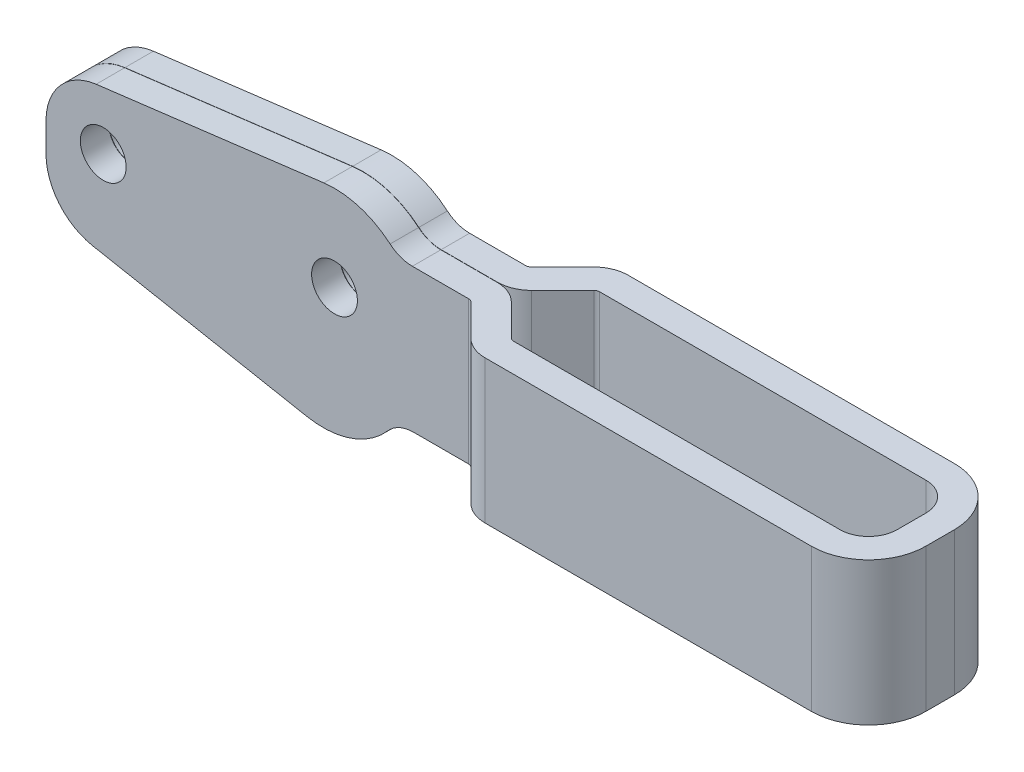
ISO-10303-21;
HEADER;
FILE_DESCRIPTION(('STEP AP214'),'2;1');
FILE_NAME('part.step','',(''),(''),'','','');
FILE_SCHEMA(('AUTOMOTIVE_DESIGN { 1 0 10303 214 1 1 1 1 }'));
ENDSEC;
DATA;
#1=APPLICATION_CONTEXT('core data for automotive mechanical design processes');
#2=APPLICATION_PROTOCOL_DEFINITION('international standard','automotive_design',2000,#1);
#3=PRODUCT_CONTEXT('',#1,'mechanical');
#4=PRODUCT('Part','Part','',(#3));
#5=PRODUCT_RELATED_PRODUCT_CATEGORY('part','',(#4));
#6=PRODUCT_DEFINITION_FORMATION('','',#4);
#7=PRODUCT_DEFINITION_CONTEXT('part definition',#1,'design');
#8=PRODUCT_DEFINITION('design','',#6,#7);
#9=PRODUCT_DEFINITION_SHAPE('','',#8);
#10=(LENGTH_UNIT() NAMED_UNIT(*) SI_UNIT(.MILLI.,.METRE.));
#11=(NAMED_UNIT(*) PLANE_ANGLE_UNIT() SI_UNIT($,.RADIAN.));
#12=(NAMED_UNIT(*) SI_UNIT($,.STERADIAN.) SOLID_ANGLE_UNIT());
#13=UNCERTAINTY_MEASURE_WITH_UNIT(LENGTH_MEASURE(1.E-05),#10,'distance_accuracy_value','');
#14=(GEOMETRIC_REPRESENTATION_CONTEXT(3) GLOBAL_UNCERTAINTY_ASSIGNED_CONTEXT((#13)) GLOBAL_UNIT_ASSIGNED_CONTEXT((#10,
#11,#12)) REPRESENTATION_CONTEXT('',''));
#15=CARTESIAN_POINT('',(0.,0.,0.));
#16=DIRECTION('',(0.,0.,1.));
#17=DIRECTION('',(1.,0.,0.));
#18=AXIS2_PLACEMENT_3D('',#15,#16,#17);
#19=CARTESIAN_POINT('',(6.35,9.52500000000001,7.9375));
#20=DIRECTION('',(0.,0.,1.));
#21=DIRECTION('',(1.,0.,0.));
#22=AXIS2_PLACEMENT_3D('',#19,#20,#21);
#23=CYLINDRICAL_SURFACE('',#22,6.35);
#24=CARTESIAN_POINT('',(6.35,9.52500000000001,-0.012699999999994));
#25=DIRECTION('',(0.,0.,-1.));
#26=DIRECTION('',(-1.,0.,0.));
#27=AXIS2_PLACEMENT_3D('',#24,#25,#26);
#28=CIRCLE('',#27,6.35);
#29=CARTESIAN_POINT('',(5.56410891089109,15.8261804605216,-0.012699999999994));
#30=VERTEX_POINT('',#29);
#31=CARTESIAN_POINT('',(0.,9.52500000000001,-0.012699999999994));
#32=VERTEX_POINT('',#31);
#33=EDGE_CURVE('E655',#30,#32,#28,.F.);
#34=ORIENTED_EDGE('',*,*,#33,.F.);
#35=DIRECTION('',(0.,0.,1.));
#36=VECTOR('',#35,1.);
#37=CARTESIAN_POINT('',(5.56410891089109,15.8261804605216,-50.9521569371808));
#38=LINE('',#37,#36);
#39=CARTESIAN_POINT('',(5.56410891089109,15.8261804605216,-3.175));
#40=VERTEX_POINT('',#39);
#41=EDGE_CURVE('E619',#40,#30,#38,.T.);
#42=ORIENTED_EDGE('',*,*,#41,.F.);
#43=CARTESIAN_POINT('',(6.35,9.52500000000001,-3.175));
#44=DIRECTION('',(0.,0.,1.));
#45=DIRECTION('',(1.,0.,0.));
#46=AXIS2_PLACEMENT_3D('',#43,#44,#45);
#47=CIRCLE('',#46,6.35);
#48=CARTESIAN_POINT('',(0.,9.52500000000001,-3.175));
#49=VERTEX_POINT('',#48);
#50=EDGE_CURVE('E547',#49,#40,#47,.F.);
#51=ORIENTED_EDGE('',*,*,#50,.F.);
#52=DIRECTION('',(0.,0.,-1.));
#53=VECTOR('',#52,1.);
#54=CARTESIAN_POINT('',(0.,9.52500000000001,-3.175));
#55=LINE('',#54,#53);
#56=EDGE_CURVE('E543',#32,#49,#55,.T.);
#57=ORIENTED_EDGE('',*,*,#56,.F.);
#58=EDGE_LOOP('',(#34,#42,#51,#57));
#59=FACE_BOUND('',#58,.T.);
#60=ADVANCED_FACE('F34',(#59),#23,.T.);
#61=CARTESIAN_POINT('',(0.,0.,7.9375));
#62=DIRECTION('',(-1.,0.,0.));
#63=DIRECTION('',(0.,0.,1.));
#64=AXIS2_PLACEMENT_3D('',#61,#62,#63);
#65=PLANE('',#64);
#66=DIRECTION('',(0.,-1.,0.));
#67=VECTOR('',#66,1.);
#68=CARTESIAN_POINT('',(0.,0.,-0.012699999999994));
#69=LINE('',#68,#67);
#70=CARTESIAN_POINT('',(0.,6.35,-0.012699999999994));
#71=VERTEX_POINT('',#70);
#72=EDGE_CURVE('E657',#32,#71,#69,.T.);
#73=ORIENTED_EDGE('',*,*,#72,.F.);
#74=ORIENTED_EDGE('',*,*,#56,.T.);
#75=DIRECTION('',(0.,1.,0.));
#76=VECTOR('',#75,1.);
#77=CARTESIAN_POINT('',(0.,0.,-3.175));
#78=LINE('',#77,#76);
#79=CARTESIAN_POINT('',(0.,6.35,-3.175));
#80=VERTEX_POINT('',#79);
#81=EDGE_CURVE('E584',#80,#49,#78,.T.);
#82=ORIENTED_EDGE('',*,*,#81,.F.);
#83=DIRECTION('',(0.,0.,-1.));
#84=VECTOR('',#83,1.);
#85=CARTESIAN_POINT('',(0.,6.35,3.175));
#86=LINE('',#85,#84);
#87=EDGE_CURVE('E555',#80,#71,#86,.F.);
#88=ORIENTED_EDGE('',*,*,#87,.T.);
#89=EDGE_LOOP('',(#73,#74,#82,#88));
#90=FACE_BOUND('',#89,.T.);
#91=ADVANCED_FACE('F706',(#90),#65,.T.);
#92=CARTESIAN_POINT('',(6.35,6.35,7.9375));
#93=DIRECTION('',(0.,0.,1.));
#94=DIRECTION('',(1.,0.,0.));
#95=AXIS2_PLACEMENT_3D('',#92,#93,#94);
#96=CYLINDRICAL_SURFACE('',#95,6.35);
#97=CARTESIAN_POINT('',(6.35,6.35,-0.012699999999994));
#98=DIRECTION('',(0.,0.,-1.));
#99=DIRECTION('',(-1.,0.,0.));
#100=AXIS2_PLACEMENT_3D('',#97,#98,#99);
#101=CIRCLE('',#100,6.35);
#102=CARTESIAN_POINT('',(5.16537628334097,0.111477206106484,-0.0126999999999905));
#103=VERTEX_POINT('',#102);
#104=EDGE_CURVE('E659',#71,#103,#101,.F.);
#105=ORIENTED_EDGE('',*,*,#104,.F.);
#106=ORIENTED_EDGE('',*,*,#87,.F.);
#107=CARTESIAN_POINT('',(6.35,6.35,-3.175));
#108=DIRECTION('',(0.,0.,1.));
#109=DIRECTION('',(1.,0.,0.));
#110=AXIS2_PLACEMENT_3D('',#107,#108,#109);
#111=CIRCLE('',#110,6.35);
#112=CARTESIAN_POINT('',(5.16537628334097,0.111477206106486,-3.175));
#113=VERTEX_POINT('',#112);
#114=EDGE_CURVE('E552',#113,#80,#111,.F.);
#115=ORIENTED_EDGE('',*,*,#114,.F.);
#116=DIRECTION('',(0.,0.,1.));
#117=VECTOR('',#116,1.);
#118=CARTESIAN_POINT('',(5.16537628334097,0.111477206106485,-50.9521569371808));
#119=LINE('',#118,#117);
#120=EDGE_CURVE('E606',#113,#103,#119,.T.);
#121=ORIENTED_EDGE('',*,*,#120,.T.);
#122=EDGE_LOOP('',(#105,#106,#115,#121));
#123=FACE_BOUND('',#122,.T.);
#124=ADVANCED_FACE('F713',(#123),#96,.T.);
#125=CARTESIAN_POINT('',(5.16537628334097,0.111477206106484,-50.9521569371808));
#126=DIRECTION('',(-0.186554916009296,-0.98244453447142,0.));
#127=DIRECTION('',(0.98244453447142,-0.186554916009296,0.));
#128=AXIS2_PLACEMENT_3D('',#125,#126,#127);
#129=PLANE('',#128);
#130=DIRECTION('',(0.98244453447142,-0.186554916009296,0.));
#131=VECTOR('',#130,1.);
#132=CARTESIAN_POINT('',(5.16537628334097,0.111477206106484,-0.0126999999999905));
#133=LINE('',#132,#131);
#134=CARTESIAN_POINT('',(28.9491307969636,-4.40478419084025,-0.0126999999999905));
#135=VERTEX_POINT('',#134);
#136=EDGE_CURVE('E661',#103,#135,#133,.T.);
#137=ORIENTED_EDGE('',*,*,#136,.F.);
#138=ORIENTED_EDGE('',*,*,#120,.F.);
#139=DIRECTION('',(0.98244453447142,-0.186554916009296,0.));
#140=VECTOR('',#139,1.);
#141=CARTESIAN_POINT('',(5.16537628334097,0.111477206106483,-3.175));
#142=LINE('',#141,#140);
#143=CARTESIAN_POINT('',(28.9491307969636,-4.40478419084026,-3.175));
#144=VERTEX_POINT('',#143);
#145=EDGE_CURVE('E630',#113,#144,#142,.T.);
#146=ORIENTED_EDGE('',*,*,#145,.T.);
#147=DIRECTION('',(0.,0.,1.));
#148=VECTOR('',#147,1.);
#149=CARTESIAN_POINT('',(28.9491307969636,-4.40478419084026,-50.9521569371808));
#150=LINE('',#149,#148);
#151=EDGE_CURVE('E611',#144,#135,#150,.T.);
#152=ORIENTED_EDGE('',*,*,#151,.T.);
#153=EDGE_LOOP('',(#137,#138,#146,#152));
#154=FACE_BOUND('',#153,.T.);
#155=ADVANCED_FACE('F822',(#154),#129,.T.);
#156=CARTESIAN_POINT('',(30.7260663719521,4.95300000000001,-50.9521569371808));
#157=DIRECTION('',(0.,0.,1.));
#158=DIRECTION('',(1.,0.,0.));
#159=AXIS2_PLACEMENT_3D('',#156,#157,#158);
#160=CYLINDRICAL_SURFACE('',#159,9.525);
#161=CARTESIAN_POINT('',(30.7260663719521,4.95300000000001,0.0127000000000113));
#162=DIRECTION('',(0.,0.,1.));
#163=DIRECTION('',(1.,0.,0.));
#164=AXIS2_PLACEMENT_3D('',#161,#162,#163);
#165=CIRCLE('',#164,9.525);
#166=CARTESIAN_POINT('',(28.9491307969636,-4.40478419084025,0.0127000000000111));
#167=VERTEX_POINT('',#166);
#168=CARTESIAN_POINT('',(37.9056880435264,-1.30628571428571,0.012700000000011));
#169=VERTEX_POINT('',#168);
#170=EDGE_CURVE('E312',#167,#169,#165,.T.);
#171=ORIENTED_EDGE('',*,*,#170,.T.);
#172=DIRECTION('',(0.,0.,1.));
#173=VECTOR('',#172,1.);
#174=CARTESIAN_POINT('',(37.9056880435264,-1.30628571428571,-50.9521569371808));
#175=LINE('',#174,#173);
#176=CARTESIAN_POINT('',(37.9056880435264,-1.30628571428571,3.175));
#177=VERTEX_POINT('',#176);
#178=EDGE_CURVE('E317',#169,#177,#175,.T.);
#179=ORIENTED_EDGE('',*,*,#178,.T.);
#180=CARTESIAN_POINT('',(30.7260663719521,4.95300000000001,3.175));
#181=DIRECTION('',(0.,0.,-1.));
#182=DIRECTION('',(-1.,0.,0.));
#183=AXIS2_PLACEMENT_3D('',#180,#181,#182);
#184=CIRCLE('',#183,9.525);
#185=CARTESIAN_POINT('',(28.9491307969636,-4.40478419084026,3.175));
#186=VERTEX_POINT('',#185);
#187=EDGE_CURVE('E617',#177,#186,#184,.T.);
#188=ORIENTED_EDGE('',*,*,#187,.T.);
#189=EDGE_CURVE('E319',#167,#186,#150,.T.);
#190=ORIENTED_EDGE('',*,*,#189,.F.);
#191=EDGE_LOOP('',(#171,#179,#188,#190));
#192=FACE_BOUND('',#191,.T.);
#193=ADVANCED_FACE('F314',(#192),#160,.T.);
#194=CARTESIAN_POINT('',(32.004,9.52500000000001,-50.9521569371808));
#195=DIRECTION('',(0.,0.,1.));
#196=DIRECTION('',(1.,0.,0.));
#197=AXIS2_PLACEMENT_3D('',#194,#195,#196);
#198=CYLINDRICAL_SURFACE('',#197,9.525);
#199=CARTESIAN_POINT('',(32.004,9.52500000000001,0.0127000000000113));
#200=DIRECTION('',(0.,0.,1.));
#201=DIRECTION('',(1.,0.,0.));
#202=AXIS2_PLACEMENT_3D('',#199,#200,#201);
#203=CIRCLE('',#202,9.525);
#204=CARTESIAN_POINT('',(30.8251633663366,18.9767706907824,0.0127000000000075));
#205=VERTEX_POINT('',#204);
#206=CARTESIAN_POINT('',(38.1732384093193,16.7821428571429,0.012700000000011));
#207=VERTEX_POINT('',#206);
#208=EDGE_CURVE('E375',#205,#207,#203,.F.);
#209=ORIENTED_EDGE('',*,*,#208,.F.);
#210=DIRECTION('',(0.,0.,1.));
#211=VECTOR('',#210,1.);
#212=CARTESIAN_POINT('',(30.8251633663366,18.9767706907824,-50.9521569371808));
#213=LINE('',#212,#211);
#214=CARTESIAN_POINT('',(30.8251633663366,18.9767706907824,3.175));
#215=VERTEX_POINT('',#214);
#216=EDGE_CURVE('E618',#205,#215,#213,.T.);
#217=ORIENTED_EDGE('',*,*,#216,.T.);
#218=CARTESIAN_POINT('',(32.004,9.52500000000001,3.175));
#219=DIRECTION('',(0.,0.,1.));
#220=DIRECTION('',(1.,0.,0.));
#221=AXIS2_PLACEMENT_3D('',#218,#219,#220);
#222=CIRCLE('',#221,9.525);
#223=CARTESIAN_POINT('',(38.1732384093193,16.7821428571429,3.175));
#224=VERTEX_POINT('',#223);
#225=EDGE_CURVE('E626',#224,#215,#222,.T.);
#226=ORIENTED_EDGE('',*,*,#225,.F.);
#227=DIRECTION('',(0.,0.,1.));
#228=VECTOR('',#227,1.);
#229=CARTESIAN_POINT('',(38.1732384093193,16.7821428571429,-50.9521569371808));
#230=LINE('',#229,#228);
#231=EDGE_CURVE('E340',#224,#207,#230,.F.);
#232=ORIENTED_EDGE('',*,*,#231,.T.);
#233=EDGE_LOOP('',(#209,#217,#226,#232));
#234=FACE_BOUND('',#233,.T.);
#235=ADVANCED_FACE('F882',(#234),#198,.T.);
#236=CARTESIAN_POINT('',(5.56410891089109,15.8261804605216,-50.9521569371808));
#237=DIRECTION('',(0.123762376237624,-0.992311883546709,0.));
#238=DIRECTION('',(0.992311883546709,0.123762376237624,0.));
#239=AXIS2_PLACEMENT_3D('',#236,#237,#238);
#240=PLANE('',#239);
#241=ORIENTED_EDGE('',*,*,#41,.T.);
#242=DIRECTION('',(0.992311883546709,0.123762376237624,0.));
#243=VECTOR('',#242,1.);
#244=CARTESIAN_POINT('',(5.56410891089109,15.8261804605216,-0.0126999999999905));
#245=LINE('',#244,#243);
#246=CARTESIAN_POINT('',(30.8251633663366,18.9767706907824,-0.0126999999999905));
#247=VERTEX_POINT('',#246);
#248=EDGE_CURVE('E649',#30,#247,#245,.T.);
#249=ORIENTED_EDGE('',*,*,#248,.T.);
#250=CARTESIAN_POINT('',(30.8251633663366,18.9767706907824,-3.175));
#251=VERTEX_POINT('',#250);
#252=EDGE_CURVE('E614',#251,#247,#213,.T.);
#253=ORIENTED_EDGE('',*,*,#252,.F.);
#254=DIRECTION('',(0.992311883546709,0.123762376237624,0.));
#255=VECTOR('',#254,1.);
#256=CARTESIAN_POINT('',(5.56410891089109,15.8261804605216,-3.175));
#257=LINE('',#256,#255);
#258=EDGE_CURVE('E623',#40,#251,#257,.T.);
#259=ORIENTED_EDGE('',*,*,#258,.F.);
#260=EDGE_LOOP('',(#241,#249,#253,#259));
#261=FACE_BOUND('',#260,.T.);
#262=ADVANCED_FACE('F807',(#261),#240,.F.);
#263=CARTESIAN_POINT('',(40.640933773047,19.685,-50.9521569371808));
#264=DIRECTION('',(0.,0.,1.));
#265=DIRECTION('',(1.,0.,0.));
#266=AXIS2_PLACEMENT_3D('',#263,#264,#265);
#267=CYLINDRICAL_SURFACE('',#266,3.81);
#268=CARTESIAN_POINT('',(38.1732384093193,16.7821428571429,-0.0126999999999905));
#269=VERTEX_POINT('',#268);
#270=CARTESIAN_POINT('',(38.1732384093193,16.7821428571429,-3.175));
#271=VERTEX_POINT('',#270);
#272=EDGE_CURVE('E345',#269,#271,#230,.F.);
#273=ORIENTED_EDGE('',*,*,#272,.F.);
#274=CARTESIAN_POINT('',(40.640933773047,19.685,-0.0126999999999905));
#275=DIRECTION('',(0.,0.,-1.));
#276=DIRECTION('',(-1.,0.,0.));
#277=AXIS2_PLACEMENT_3D('',#274,#275,#276);
#278=CIRCLE('',#277,3.81);
#279=CARTESIAN_POINT('',(40.640933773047,15.875,-0.012699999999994));
#280=VERTEX_POINT('',#279);
#281=EDGE_CURVE('E644',#269,#280,#278,.F.);
#282=ORIENTED_EDGE('',*,*,#281,.T.);
#283=DIRECTION('',(0.,0.,1.));
#284=VECTOR('',#283,1.);
#285=CARTESIAN_POINT('',(40.640933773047,15.875,7.9375));
#286=LINE('',#285,#284);
#287=CARTESIAN_POINT('',(40.640933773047,15.875,-3.17500000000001));
#288=VERTEX_POINT('',#287);
#289=EDGE_CURVE('E561',#288,#280,#286,.T.);
#290=ORIENTED_EDGE('',*,*,#289,.F.);
#291=CARTESIAN_POINT('',(40.640933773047,19.685,-3.175));
#292=DIRECTION('',(0.,0.,1.));
#293=DIRECTION('',(1.,0.,0.));
#294=AXIS2_PLACEMENT_3D('',#291,#292,#293);
#295=CIRCLE('',#294,3.81);
#296=EDGE_CURVE('E353',#271,#288,#295,.T.);
#297=ORIENTED_EDGE('',*,*,#296,.F.);
#298=EDGE_LOOP('',(#273,#282,#290,#297));
#299=FACE_BOUND('',#298,.T.);
#300=ADVANCED_FACE('F799',(#299),#267,.F.);
#301=CARTESIAN_POINT('',(40.7775367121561,-3.81,-50.9521569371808));
#302=DIRECTION('',(0.,0.,1.));
#303=DIRECTION('',(1.,0.,0.));
#304=AXIS2_PLACEMENT_3D('',#301,#302,#303);
#305=CYLINDRICAL_SURFACE('',#304,3.81);
#306=DIRECTION('',(0.,0.,-1.));
#307=VECTOR('',#306,1.);
#308=CARTESIAN_POINT('',(40.7775367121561,0.,-3.175));
#309=LINE('',#308,#307);
#310=CARTESIAN_POINT('',(40.7775367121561,0.,-0.0126999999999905));
#311=VERTEX_POINT('',#310);
#312=CARTESIAN_POINT('',(40.7775367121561,0.,-3.17500000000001));
#313=VERTEX_POINT('',#312);
#314=EDGE_CURVE('E343',#311,#313,#309,.T.);
#315=ORIENTED_EDGE('',*,*,#314,.F.);
#316=CARTESIAN_POINT('',(40.7775367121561,-3.81,-0.0126999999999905));
#317=DIRECTION('',(0.,0.,-1.));
#318=DIRECTION('',(-1.,0.,0.));
#319=AXIS2_PLACEMENT_3D('',#316,#317,#318);
#320=CIRCLE('',#319,3.81);
#321=CARTESIAN_POINT('',(37.9056880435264,-1.30628571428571,-0.0126999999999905));
#322=VERTEX_POINT('',#321);
#323=EDGE_CURVE('E666',#311,#322,#320,.F.);
#324=ORIENTED_EDGE('',*,*,#323,.T.);
#325=CARTESIAN_POINT('',(37.9056880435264,-1.30628571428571,-3.175));
#326=VERTEX_POINT('',#325);
#327=EDGE_CURVE('E339',#326,#322,#175,.T.);
#328=ORIENTED_EDGE('',*,*,#327,.F.);
#329=CARTESIAN_POINT('',(40.7775367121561,-3.81,-3.175));
#330=DIRECTION('',(0.,0.,1.));
#331=DIRECTION('',(1.,0.,0.));
#332=AXIS2_PLACEMENT_3D('',#329,#330,#331);
#333=CIRCLE('',#332,3.81);
#334=EDGE_CURVE('E356',#313,#326,#333,.T.);
#335=ORIENTED_EDGE('',*,*,#334,.F.);
#336=EDGE_LOOP('',(#315,#324,#328,#335));
#337=FACE_BOUND('',#336,.T.);
#338=ADVANCED_FACE('F831',(#337),#305,.F.);
#339=CARTESIAN_POINT('',(6.35,9.52500000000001,-7.9375));
#340=DIRECTION('',(0.,0.,1.));
#341=DIRECTION('',(1.,0.,0.));
#342=AXIS2_PLACEMENT_3D('',#339,#340,#341);
#343=CYLINDRICAL_SURFACE('',#342,2.54);
#344=CARTESIAN_POINT('',(6.35,9.52500000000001,-0.012699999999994));
#345=DIRECTION('',(0.,0.,-1.));
#346=DIRECTION('',(-1.,0.,0.));
#347=AXIS2_PLACEMENT_3D('',#344,#345,#346);
#348=CIRCLE('',#347,2.54);
#349=CARTESIAN_POINT('',(3.81,9.52500000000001,-0.012699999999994));
#350=VERTEX_POINT('',#349);
#351=EDGE_CURVE('E374',#350,#350,#348,.F.);
#352=ORIENTED_EDGE('',*,*,#351,.T.);
#353=EDGE_LOOP('',(#352));
#354=FACE_BOUND('',#353,.T.);
#355=CARTESIAN_POINT('',(6.35,9.52500000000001,-3.175));
#356=DIRECTION('',(0.,0.,1.));
#357=DIRECTION('',(1.,0.,0.));
#358=AXIS2_PLACEMENT_3D('',#355,#356,#357);
#359=CIRCLE('',#358,2.54);
#360=CARTESIAN_POINT('',(8.89,9.52500000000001,-3.175));
#361=VERTEX_POINT('',#360);
#362=EDGE_CURVE('E359',#361,#361,#359,.T.);
#363=ORIENTED_EDGE('',*,*,#362,.F.);
#364=EDGE_LOOP('',(#363));
#365=FACE_BOUND('',#364,.T.);
#366=ADVANCED_FACE('F1100',(#354,#365),#343,.F.);
#367=CARTESIAN_POINT('',(32.004,9.52500000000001,-7.9375));
#368=DIRECTION('',(0.,0.,1.));
#369=DIRECTION('',(1.,0.,0.));
#370=AXIS2_PLACEMENT_3D('',#367,#368,#369);
#371=CYLINDRICAL_SURFACE('',#370,2.54);
#372=CARTESIAN_POINT('',(32.004,9.52500000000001,-0.012699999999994));
#373=DIRECTION('',(0.,0.,-1.));
#374=DIRECTION('',(-1.,0.,0.));
#375=AXIS2_PLACEMENT_3D('',#372,#373,#374);
#376=CIRCLE('',#375,2.54);
#377=CARTESIAN_POINT('',(29.464,9.52500000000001,-0.012699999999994));
#378=VERTEX_POINT('',#377);
#379=EDGE_CURVE('E371',#378,#378,#376,.F.);
#380=ORIENTED_EDGE('',*,*,#379,.T.);
#381=EDGE_LOOP('',(#380));
#382=FACE_BOUND('',#381,.T.);
#383=CARTESIAN_POINT('',(32.004,9.52500000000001,-3.175));
#384=DIRECTION('',(0.,0.,1.));
#385=DIRECTION('',(1.,0.,0.));
#386=AXIS2_PLACEMENT_3D('',#383,#384,#385);
#387=CIRCLE('',#386,2.54);
#388=CARTESIAN_POINT('',(34.544,9.52500000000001,-3.175));
#389=VERTEX_POINT('',#388);
#390=EDGE_CURVE('E364',#389,#389,#387,.T.);
#391=ORIENTED_EDGE('',*,*,#390,.F.);
#392=EDGE_LOOP('',(#391));
#393=FACE_BOUND('',#392,.T.);
#394=ADVANCED_FACE('F704',(#382,#393),#371,.F.);
#395=CARTESIAN_POINT('',(0.,0.,7.9375));
#396=DIRECTION('',(0.,1.,0.));
#397=DIRECTION('',(0.,0.,1.));
#398=AXIS2_PLACEMENT_3D('',#395,#396,#397);
#399=PLANE('',#398);
#400=DIRECTION('',(-0.707106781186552,0.,0.707106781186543));
#401=VECTOR('',#400,1.);
#402=CARTESIAN_POINT('',(53.213,0.,-4.7625));
#403=LINE('',#402,#401);
#404=CARTESIAN_POINT('',(53.0270128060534,0.,-4.57651280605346));
#405=VERTEX_POINT('',#404);
#406=CARTESIAN_POINT('',(49.5791231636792,0.,-1.12862316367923));
#407=VERTEX_POINT('',#406);
#408=EDGE_CURVE('E393',#405,#407,#403,.T.);
#409=ORIENTED_EDGE('',*,*,#408,.T.);
#410=CARTESIAN_POINT('',(46.8850463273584,0.,-3.82269999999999));
#411=DIRECTION('',(0.,1.,0.));
#412=DIRECTION('',(0.,0.,1.));
#413=AXIS2_PLACEMENT_3D('',#410,#411,#412);
#414=CIRCLE('',#413,3.81);
#415=CARTESIAN_POINT('',(46.8850463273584,0.,-0.012699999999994));
#416=VERTEX_POINT('',#415);
#417=EDGE_CURVE('E56',#407,#416,#414,.F.);
#418=ORIENTED_EDGE('',*,*,#417,.T.);
#419=DIRECTION('',(-1.,0.,0.));
#420=VECTOR('',#419,1.);
#421=CARTESIAN_POINT('',(0.,0.,-0.012699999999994));
#422=LINE('',#421,#420);
#423=EDGE_CURVE('E653',#416,#311,#422,.T.);
#424=ORIENTED_EDGE('',*,*,#423,.T.);
#425=ORIENTED_EDGE('',*,*,#314,.T.);
#426=DIRECTION('',(1.,0.,0.));
#427=VECTOR('',#426,1.);
#428=CARTESIAN_POINT('',(-2.11806403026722,0.,-3.175));
#429=LINE('',#428,#427);
#430=CARTESIAN_POINT('',(46.8723463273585,0.,-3.17500000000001));
#431=VERTEX_POINT('',#430);
#432=EDGE_CURVE('E599',#313,#431,#429,.T.);
#433=ORIENTED_EDGE('',*,*,#432,.T.);
#434=CARTESIAN_POINT('',(46.8723463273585,0.,-3.81000000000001));
#435=DIRECTION('',(0.,1.,0.));
#436=DIRECTION('',(0.,0.,1.));
#437=AXIS2_PLACEMENT_3D('',#434,#435,#436);
#438=CIRCLE('',#437,0.635);
#439=CARTESIAN_POINT('',(47.3213591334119,0.,-3.36098719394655));
#440=VERTEX_POINT('',#439);
#441=EDGE_CURVE('E471',#431,#440,#438,.T.);
#442=ORIENTED_EDGE('',*,*,#441,.T.);
#443=DIRECTION('',(0.707106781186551,0.,-0.707106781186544));
#444=VECTOR('',#443,1.);
#445=CARTESIAN_POINT('',(47.1353719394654,0.,-3.17500000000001));
#446=LINE('',#445,#444);
#447=CARTESIAN_POINT('',(50.7819487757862,0.,-6.82157683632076));
#448=VERTEX_POINT('',#447);
#449=EDGE_CURVE('E589',#440,#448,#446,.T.);
#450=ORIENTED_EDGE('',*,*,#449,.T.);
#451=CARTESIAN_POINT('',(53.4760256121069,0.,-4.1275));
#452=DIRECTION('',(0.,1.,0.));
#453=DIRECTION('',(0.,0.,1.));
#454=AXIS2_PLACEMENT_3D('',#451,#452,#453);
#455=CIRCLE('',#454,3.81);
#456=CARTESIAN_POINT('',(53.4760256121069,0.,-7.9375));
#457=VERTEX_POINT('',#456);
#458=EDGE_CURVE('E497',#448,#457,#455,.F.);
#459=ORIENTED_EDGE('',*,*,#458,.T.);
#460=DIRECTION('',(1.,0.,0.));
#461=VECTOR('',#460,1.);
#462=CARTESIAN_POINT('',(0.,0.,-7.9375));
#463=LINE('',#462,#461);
#464=CARTESIAN_POINT('',(89.662,0.,-7.9375));
#465=VERTEX_POINT('',#464);
#466=EDGE_CURVE('E433',#457,#465,#463,.T.);
#467=ORIENTED_EDGE('',*,*,#466,.T.);
#468=CARTESIAN_POINT('',(89.662,0.,-1.5875));
#469=DIRECTION('',(0.,1.,0.));
#470=DIRECTION('',(0.,0.,1.));
#471=AXIS2_PLACEMENT_3D('',#468,#469,#470);
#472=CIRCLE('',#471,6.35);
#473=CARTESIAN_POINT('',(96.012,0.,-1.5875));
#474=VERTEX_POINT('',#473);
#475=EDGE_CURVE('E530',#465,#474,#472,.F.);
#476=ORIENTED_EDGE('',*,*,#475,.T.);
#477=DIRECTION('',(0.,0.,-1.));
#478=VECTOR('',#477,1.);
#479=CARTESIAN_POINT('',(96.012,0.,7.9375));
#480=LINE('',#479,#478);
#481=CARTESIAN_POINT('',(96.012,0.,1.5875));
#482=VERTEX_POINT('',#481);
#483=EDGE_CURVE('E442',#482,#474,#480,.T.);
#484=ORIENTED_EDGE('',*,*,#483,.F.);
#485=CARTESIAN_POINT('',(89.662,0.,1.5875));
#486=DIRECTION('',(0.,1.,0.));
#487=DIRECTION('',(0.,0.,1.));
#488=AXIS2_PLACEMENT_3D('',#485,#486,#487);
#489=CIRCLE('',#488,6.35);
#490=CARTESIAN_POINT('',(89.662,0.,7.9375));
#491=VERTEX_POINT('',#490);
#492=EDGE_CURVE('E532',#482,#491,#489,.F.);
#493=ORIENTED_EDGE('',*,*,#492,.T.);
#494=DIRECTION('',(1.,0.,0.));
#495=VECTOR('',#494,1.);
#496=CARTESIAN_POINT('',(0.,0.,7.9375));
#497=LINE('',#496,#495);
#498=CARTESIAN_POINT('',(53.4760256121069,0.,7.9375));
#499=VERTEX_POINT('',#498);
#500=EDGE_CURVE('E432',#499,#491,#497,.T.);
#501=ORIENTED_EDGE('',*,*,#500,.F.);
#502=CARTESIAN_POINT('',(53.4760256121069,0.,4.1275));
#503=DIRECTION('',(0.,1.,0.));
#504=DIRECTION('',(0.,0.,1.));
#505=AXIS2_PLACEMENT_3D('',#502,#503,#504);
#506=CIRCLE('',#505,3.81);
#507=CARTESIAN_POINT('',(50.7819487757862,0.,6.82157683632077));
#508=VERTEX_POINT('',#507);
#509=EDGE_CURVE('E499',#499,#508,#506,.F.);
#510=ORIENTED_EDGE('',*,*,#509,.T.);
#511=DIRECTION('',(0.707106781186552,0.,0.707106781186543));
#512=VECTOR('',#511,1.);
#513=CARTESIAN_POINT('',(47.1353719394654,0.,3.17500000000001));
#514=LINE('',#513,#512);
#515=CARTESIAN_POINT('',(47.3213591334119,0.,3.36098719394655));
#516=VERTEX_POINT('',#515);
#517=EDGE_CURVE('E592',#516,#508,#514,.T.);
#518=ORIENTED_EDGE('',*,*,#517,.F.);
#519=CARTESIAN_POINT('',(46.8723463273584,0.,3.81000000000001));
#520=DIRECTION('',(0.,1.,0.));
#521=DIRECTION('',(0.,0.,1.));
#522=AXIS2_PLACEMENT_3D('',#519,#520,#521);
#523=CIRCLE('',#522,0.635);
#524=CARTESIAN_POINT('',(46.8723463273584,0.,3.17500000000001));
#525=VERTEX_POINT('',#524);
#526=EDGE_CURVE('E478',#516,#525,#523,.T.);
#527=ORIENTED_EDGE('',*,*,#526,.T.);
#528=DIRECTION('',(1.,0.,0.));
#529=VECTOR('',#528,1.);
#530=CARTESIAN_POINT('',(-2.11806403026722,0.,3.175));
#531=LINE('',#530,#529);
#532=CARTESIAN_POINT('',(40.7775367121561,0.,3.17500000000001));
#533=VERTEX_POINT('',#532);
#534=EDGE_CURVE('E587',#533,#525,#531,.T.);
#535=ORIENTED_EDGE('',*,*,#534,.F.);
#536=CARTESIAN_POINT('',(40.7775367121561,0.,0.0127000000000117));
#537=VERTEX_POINT('',#536);
#538=EDGE_CURVE('E349',#533,#537,#309,.T.);
#539=ORIENTED_EDGE('',*,*,#538,.T.);
#540=DIRECTION('',(1.,0.,0.));
#541=VECTOR('',#540,1.);
#542=CARTESIAN_POINT('',(0.,0.,0.0127000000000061));
#543=LINE('',#542,#541);
#544=CARTESIAN_POINT('',(46.8850463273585,0.,0.0127000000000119));
#545=VERTEX_POINT('',#544);
#546=EDGE_CURVE('E323',#537,#545,#543,.T.);
#547=ORIENTED_EDGE('',*,*,#546,.T.);
#548=CARTESIAN_POINT('',(46.8850463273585,0.,3.82270000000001));
#549=DIRECTION('',(0.,1.,0.));
#550=DIRECTION('',(0.,0.,1.));
#551=AXIS2_PLACEMENT_3D('',#548,#549,#550);
#552=CIRCLE('',#551,3.81);
#553=CARTESIAN_POINT('',(49.5791231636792,0.,1.12862316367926));
#554=VERTEX_POINT('',#553);
#555=EDGE_CURVE('E382',#545,#554,#552,.F.);
#556=ORIENTED_EDGE('',*,*,#555,.T.);
#557=DIRECTION('',(0.70710678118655,0.,0.707106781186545));
#558=VECTOR('',#557,1.);
#559=CARTESIAN_POINT('',(48.4504999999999,0.,0.));
#560=LINE('',#559,#558);
#561=CARTESIAN_POINT('',(53.0270128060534,0.,4.57651280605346));
#562=VERTEX_POINT('',#561);
#563=EDGE_CURVE('E403',#554,#562,#560,.T.);
#564=ORIENTED_EDGE('',*,*,#563,.T.);
#565=CARTESIAN_POINT('',(53.4760256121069,0.,4.1275));
#566=DIRECTION('',(0.,1.,0.));
#567=DIRECTION('',(0.,0.,1.));
#568=AXIS2_PLACEMENT_3D('',#565,#566,#567);
#569=CIRCLE('',#568,0.635);
#570=CARTESIAN_POINT('',(53.4760256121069,0.,4.7625));
#571=VERTEX_POINT('',#570);
#572=EDGE_CURVE('E484',#562,#571,#569,.T.);
#573=ORIENTED_EDGE('',*,*,#572,.T.);
#574=DIRECTION('',(-1.,0.,0.));
#575=VECTOR('',#574,1.);
#576=CARTESIAN_POINT('',(92.837,0.,4.7625));
#577=LINE('',#576,#575);
#578=CARTESIAN_POINT('',(89.662,0.,4.7625));
#579=VERTEX_POINT('',#578);
#580=EDGE_CURVE('E406',#579,#571,#577,.T.);
#581=ORIENTED_EDGE('',*,*,#580,.F.);
#582=CARTESIAN_POINT('',(89.662,0.,1.5875));
#583=DIRECTION('',(0.,1.,0.));
#584=DIRECTION('',(0.,0.,1.));
#585=AXIS2_PLACEMENT_3D('',#582,#583,#584);
#586=CIRCLE('',#585,3.175);
#587=CARTESIAN_POINT('',(92.837,0.,1.5875));
#588=VERTEX_POINT('',#587);
#589=EDGE_CURVE('E523',#579,#588,#586,.T.);
#590=ORIENTED_EDGE('',*,*,#589,.T.);
#591=DIRECTION('',(0.,0.,-1.));
#592=VECTOR('',#591,1.);
#593=CARTESIAN_POINT('',(92.837,0.,4.7625));
#594=LINE('',#593,#592);
#595=CARTESIAN_POINT('',(92.837,0.,-1.58749999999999));
#596=VERTEX_POINT('',#595);
#597=EDGE_CURVE('E416',#588,#596,#594,.T.);
#598=ORIENTED_EDGE('',*,*,#597,.T.);
#599=CARTESIAN_POINT('',(89.662,0.,-1.5875));
#600=DIRECTION('',(0.,1.,0.));
#601=DIRECTION('',(0.,0.,1.));
#602=AXIS2_PLACEMENT_3D('',#599,#600,#601);
#603=CIRCLE('',#602,3.175);
#604=CARTESIAN_POINT('',(89.662,0.,-4.76249999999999));
#605=VERTEX_POINT('',#604);
#606=EDGE_CURVE('E519',#596,#605,#603,.T.);
#607=ORIENTED_EDGE('',*,*,#606,.T.);
#608=DIRECTION('',(1.,0.,0.));
#609=VECTOR('',#608,1.);
#610=CARTESIAN_POINT('',(53.213,0.,-4.7625));
#611=LINE('',#610,#609);
#612=CARTESIAN_POINT('',(53.4760256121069,0.,-4.7625));
#613=VERTEX_POINT('',#612);
#614=EDGE_CURVE('E419',#613,#605,#611,.T.);
#615=ORIENTED_EDGE('',*,*,#614,.F.);
#616=CARTESIAN_POINT('',(53.4760256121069,0.,-4.1275));
#617=DIRECTION('',(0.,1.,0.));
#618=DIRECTION('',(0.,0.,1.));
#619=AXIS2_PLACEMENT_3D('',#616,#617,#618);
#620=CIRCLE('',#619,0.635);
#621=EDGE_CURVE('E402',#613,#405,#620,.T.);
#622=ORIENTED_EDGE('',*,*,#621,.T.);
#623=EDGE_LOOP('',(#409,#418,#424,#425,#433,#442,#450,#459,#467,#476,#484,#493,#501,#510,#518,
#527,#535,#539,#547,#556,#564,#573,#581,#590,#598,#607,#615,#622));
#624=FACE_BOUND('',#623,.T.);
#625=ADVANCED_FACE('F399',(#624),#399,.F.);
#626=CARTESIAN_POINT('',(6.35,9.52500000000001,0.0127000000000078));
#627=DIRECTION('',(0.,0.,1.));
#628=DIRECTION('',(1.,0.,0.));
#629=AXIS2_PLACEMENT_3D('',#626,#627,#628);
#630=CIRCLE('',#629,6.35);
#631=CARTESIAN_POINT('',(0.,9.52500000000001,0.0127000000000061));
#632=VERTEX_POINT('',#631);
#633=CARTESIAN_POINT('',(5.56410891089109,15.8261804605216,0.0127000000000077));
#634=VERTEX_POINT('',#633);
#635=EDGE_CURVE('E677',#632,#634,#630,.F.);
#636=ORIENTED_EDGE('',*,*,#635,.F.);
#637=CARTESIAN_POINT('',(0.,9.52500000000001,3.175));
#638=VERTEX_POINT('',#637);
#639=EDGE_CURVE('E544',#638,#632,#55,.T.);
#640=ORIENTED_EDGE('',*,*,#639,.F.);
#641=CARTESIAN_POINT('',(6.35,9.52500000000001,3.175));
#642=DIRECTION('',(0.,0.,1.));
#643=DIRECTION('',(1.,0.,0.));
#644=AXIS2_PLACEMENT_3D('',#641,#642,#643);
#645=CIRCLE('',#644,6.35);
#646=CARTESIAN_POINT('',(5.56410891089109,15.8261804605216,3.175));
#647=VERTEX_POINT('',#646);
#648=EDGE_CURVE('E550',#647,#638,#645,.T.);
#649=ORIENTED_EDGE('',*,*,#648,.F.);
#650=EDGE_CURVE('E362',#634,#647,#38,.T.);
#651=ORIENTED_EDGE('',*,*,#650,.F.);
#652=EDGE_LOOP('',(#636,#640,#649,#651));
#653=FACE_BOUND('',#652,.T.);
#654=ADVANCED_FACE('F709',(#653),#23,.T.);
#655=DIRECTION('',(0.,1.,0.));
#656=VECTOR('',#655,1.);
#657=CARTESIAN_POINT('',(0.,0.,0.0127000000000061));
#658=LINE('',#657,#656);
#659=CARTESIAN_POINT('',(0.,6.35,0.0127000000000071));
#660=VERTEX_POINT('',#659);
#661=EDGE_CURVE('E679',#660,#632,#658,.T.);
#662=ORIENTED_EDGE('',*,*,#661,.F.);
#663=CARTESIAN_POINT('',(0.,6.35,3.175));
#664=VERTEX_POINT('',#663);
#665=EDGE_CURVE('E554',#660,#664,#86,.F.);
#666=ORIENTED_EDGE('',*,*,#665,.T.);
#667=DIRECTION('',(0.,1.,0.));
#668=VECTOR('',#667,1.);
#669=CARTESIAN_POINT('',(0.,0.,3.175));
#670=LINE('',#669,#668);
#671=EDGE_CURVE('E412',#664,#638,#670,.T.);
#672=ORIENTED_EDGE('',*,*,#671,.T.);
#673=ORIENTED_EDGE('',*,*,#639,.T.);
#674=EDGE_LOOP('',(#662,#666,#672,#673));
#675=FACE_BOUND('',#674,.T.);
#676=ADVANCED_FACE('F716',(#675),#65,.T.);
#677=CARTESIAN_POINT('',(96.012,15.875,7.9375));
#678=DIRECTION('',(0.,-1.,0.));
#679=DIRECTION('',(1.,0.,0.));
#680=AXIS2_PLACEMENT_3D('',#677,#678,#679);
#681=PLANE('',#680);
#682=DIRECTION('',(1.,0.,0.));
#683=VECTOR('',#682,1.);
#684=CARTESIAN_POINT('',(96.012,15.875,-0.012699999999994));
#685=LINE('',#684,#683);
#686=CARTESIAN_POINT('',(46.8850463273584,15.875,-0.012699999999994));
#687=VERTEX_POINT('',#686);
#688=EDGE_CURVE('E647',#280,#687,#685,.T.);
#689=ORIENTED_EDGE('',*,*,#688,.T.);
#690=CARTESIAN_POINT('',(46.8850463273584,15.875,-3.82269999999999));
#691=DIRECTION('',(0.,-1.,0.));
#692=DIRECTION('',(1.,0.,0.));
#693=AXIS2_PLACEMENT_3D('',#690,#691,#692);
#694=CIRCLE('',#693,3.81);
#695=CARTESIAN_POINT('',(49.5791231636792,15.875,-1.12862316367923));
#696=VERTEX_POINT('',#695);
#697=EDGE_CURVE('E11',#687,#696,#694,.F.);
#698=ORIENTED_EDGE('',*,*,#697,.T.);
#699=DIRECTION('',(-0.707106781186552,0.,0.707106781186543));
#700=VECTOR('',#699,1.);
#701=CARTESIAN_POINT('',(53.213,15.875,-4.7625));
#702=LINE('',#701,#700);
#703=CARTESIAN_POINT('',(53.0270128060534,15.875,-4.57651280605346));
#704=VERTEX_POINT('',#703);
#705=EDGE_CURVE('E396',#704,#696,#702,.T.);
#706=ORIENTED_EDGE('',*,*,#705,.F.);
#707=CARTESIAN_POINT('',(53.4760256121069,15.875,-4.1275));
#708=DIRECTION('',(0.,-1.,0.));
#709=DIRECTION('',(1.,0.,0.));
#710=AXIS2_PLACEMENT_3D('',#707,#708,#709);
#711=CIRCLE('',#710,0.635);
#712=CARTESIAN_POINT('',(53.4760256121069,15.875,-4.7625));
#713=VERTEX_POINT('',#712);
#714=EDGE_CURVE('E473',#704,#713,#711,.T.);
#715=ORIENTED_EDGE('',*,*,#714,.T.);
#716=DIRECTION('',(1.,0.,0.));
#717=VECTOR('',#716,1.);
#718=CARTESIAN_POINT('',(53.213,15.875,-4.7625));
#719=LINE('',#718,#717);
#720=CARTESIAN_POINT('',(89.662,15.875,-4.76249999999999));
#721=VERTEX_POINT('',#720);
#722=EDGE_CURVE('E404',#713,#721,#719,.T.);
#723=ORIENTED_EDGE('',*,*,#722,.T.);
#724=CARTESIAN_POINT('',(89.662,15.875,-1.5875));
#725=DIRECTION('',(0.,-1.,0.));
#726=DIRECTION('',(1.,0.,0.));
#727=AXIS2_PLACEMENT_3D('',#724,#725,#726);
#728=CIRCLE('',#727,3.175);
#729=CARTESIAN_POINT('',(92.837,15.875,-1.58749999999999));
#730=VERTEX_POINT('',#729);
#731=EDGE_CURVE('E517',#721,#730,#728,.T.);
#732=ORIENTED_EDGE('',*,*,#731,.T.);
#733=DIRECTION('',(0.,0.,-1.));
#734=VECTOR('',#733,1.);
#735=CARTESIAN_POINT('',(92.837,15.875,4.7625));
#736=LINE('',#735,#734);
#737=CARTESIAN_POINT('',(92.837,15.875,1.5875));
#738=VERTEX_POINT('',#737);
#739=EDGE_CURVE('E409',#738,#730,#736,.T.);
#740=ORIENTED_EDGE('',*,*,#739,.F.);
#741=CARTESIAN_POINT('',(89.662,15.875,1.5875));
#742=DIRECTION('',(0.,-1.,0.));
#743=DIRECTION('',(1.,0.,0.));
#744=AXIS2_PLACEMENT_3D('',#741,#742,#743);
#745=CIRCLE('',#744,3.175);
#746=CARTESIAN_POINT('',(89.662,15.875,4.7625));
#747=VERTEX_POINT('',#746);
#748=EDGE_CURVE('E521',#738,#747,#745,.T.);
#749=ORIENTED_EDGE('',*,*,#748,.T.);
#750=DIRECTION('',(-1.,0.,0.));
#751=VECTOR('',#750,1.);
#752=CARTESIAN_POINT('',(92.837,15.875,4.7625));
#753=LINE('',#752,#751);
#754=CARTESIAN_POINT('',(53.4760256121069,15.875,4.7625));
#755=VERTEX_POINT('',#754);
#756=EDGE_CURVE('E426',#747,#755,#753,.T.);
#757=ORIENTED_EDGE('',*,*,#756,.T.);
#758=CARTESIAN_POINT('',(53.4760256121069,15.875,4.1275));
#759=DIRECTION('',(0.,-1.,0.));
#760=DIRECTION('',(1.,0.,0.));
#761=AXIS2_PLACEMENT_3D('',#758,#759,#760);
#762=CIRCLE('',#761,0.635);
#763=CARTESIAN_POINT('',(53.0270128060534,15.875,4.57651280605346));
#764=VERTEX_POINT('',#763);
#765=EDGE_CURVE('E481',#755,#764,#762,.T.);
#766=ORIENTED_EDGE('',*,*,#765,.T.);
#767=DIRECTION('',(0.70710678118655,0.,0.707106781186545));
#768=VECTOR('',#767,1.);
#769=CARTESIAN_POINT('',(48.4504999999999,15.875,0.));
#770=LINE('',#769,#768);
#771=CARTESIAN_POINT('',(49.5791231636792,15.875,1.12862316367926));
#772=VERTEX_POINT('',#771);
#773=EDGE_CURVE('E424',#772,#764,#770,.T.);
#774=ORIENTED_EDGE('',*,*,#773,.F.);
#775=CARTESIAN_POINT('',(46.8850463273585,15.875,3.82270000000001));
#776=DIRECTION('',(0.,-1.,0.));
#777=DIRECTION('',(1.,0.,0.));
#778=AXIS2_PLACEMENT_3D('',#775,#776,#777);
#779=CIRCLE('',#778,3.81);
#780=CARTESIAN_POINT('',(46.8850463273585,15.875,0.0127000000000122));
#781=VERTEX_POINT('',#780);
#782=EDGE_CURVE('E378',#772,#781,#779,.F.);
#783=ORIENTED_EDGE('',*,*,#782,.T.);
#784=DIRECTION('',(-1.,0.,0.));
#785=VECTOR('',#784,1.);
#786=CARTESIAN_POINT('',(96.012,15.875,0.0127000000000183));
#787=LINE('',#786,#785);
#788=CARTESIAN_POINT('',(40.640933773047,15.875,0.0127000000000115));
#789=VERTEX_POINT('',#788);
#790=EDGE_CURVE('E572',#781,#789,#787,.T.);
#791=ORIENTED_EDGE('',*,*,#790,.T.);
#792=CARTESIAN_POINT('',(40.640933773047,15.875,3.17500000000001));
#793=VERTEX_POINT('',#792);
#794=EDGE_CURVE('E560',#789,#793,#286,.T.);
#795=ORIENTED_EDGE('',*,*,#794,.T.);
#796=DIRECTION('',(1.,0.,0.));
#797=VECTOR('',#796,1.);
#798=CARTESIAN_POINT('',(-2.11806403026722,15.875,3.175));
#799=LINE('',#798,#797);
#800=CARTESIAN_POINT('',(46.8723463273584,15.875,3.17500000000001));
#801=VERTEX_POINT('',#800);
#802=EDGE_CURVE('E570',#793,#801,#799,.T.);
#803=ORIENTED_EDGE('',*,*,#802,.T.);
#804=CARTESIAN_POINT('',(46.8723463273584,15.875,3.81000000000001));
#805=DIRECTION('',(0.,-1.,0.));
#806=DIRECTION('',(1.,0.,0.));
#807=AXIS2_PLACEMENT_3D('',#804,#805,#806);
#808=CIRCLE('',#807,0.635);
#809=CARTESIAN_POINT('',(47.3213591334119,15.875,3.36098719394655));
#810=VERTEX_POINT('',#809);
#811=EDGE_CURVE('E476',#801,#810,#808,.T.);
#812=ORIENTED_EDGE('',*,*,#811,.T.);
#813=DIRECTION('',(0.707106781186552,0.,0.707106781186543));
#814=VECTOR('',#813,1.);
#815=CARTESIAN_POINT('',(47.1353719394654,15.875,3.17500000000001));
#816=LINE('',#815,#814);
#817=CARTESIAN_POINT('',(50.7819487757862,15.875,6.82157683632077));
#818=VERTEX_POINT('',#817);
#819=EDGE_CURVE('E583',#810,#818,#816,.T.);
#820=ORIENTED_EDGE('',*,*,#819,.T.);
#821=CARTESIAN_POINT('',(53.4760256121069,15.875,4.1275));
#822=DIRECTION('',(0.,-1.,0.));
#823=DIRECTION('',(1.,0.,0.));
#824=AXIS2_PLACEMENT_3D('',#821,#822,#823);
#825=CIRCLE('',#824,3.81);
#826=CARTESIAN_POINT('',(53.4760256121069,15.875,7.9375));
#827=VERTEX_POINT('',#826);
#828=EDGE_CURVE('E492',#818,#827,#825,.F.);
#829=ORIENTED_EDGE('',*,*,#828,.T.);
#830=DIRECTION('',(-1.,0.,0.));
#831=VECTOR('',#830,1.);
#832=CARTESIAN_POINT('',(96.012,15.875,7.9375));
#833=LINE('',#832,#831);
#834=CARTESIAN_POINT('',(89.662,15.875,7.9375));
#835=VERTEX_POINT('',#834);
#836=EDGE_CURVE('E430',#835,#827,#833,.T.);
#837=ORIENTED_EDGE('',*,*,#836,.F.);
#838=CARTESIAN_POINT('',(89.662,15.875,1.5875));
#839=DIRECTION('',(0.,-1.,0.));
#840=DIRECTION('',(1.,0.,0.));
#841=AXIS2_PLACEMENT_3D('',#838,#839,#840);
#842=CIRCLE('',#841,6.35);
#843=CARTESIAN_POINT('',(96.012,15.875,1.5875));
#844=VERTEX_POINT('',#843);
#845=EDGE_CURVE('E538',#835,#844,#842,.F.);
#846=ORIENTED_EDGE('',*,*,#845,.T.);
#847=DIRECTION('',(0.,0.,-1.));
#848=VECTOR('',#847,1.);
#849=CARTESIAN_POINT('',(96.012,15.875,7.9375));
#850=LINE('',#849,#848);
#851=CARTESIAN_POINT('',(96.012,15.875,-1.5875));
#852=VERTEX_POINT('',#851);
#853=EDGE_CURVE('E437',#844,#852,#850,.T.);
#854=ORIENTED_EDGE('',*,*,#853,.T.);
#855=CARTESIAN_POINT('',(89.662,15.875,-1.5875));
#856=DIRECTION('',(0.,-1.,0.));
#857=DIRECTION('',(1.,0.,0.));
#858=AXIS2_PLACEMENT_3D('',#855,#856,#857);
#859=CIRCLE('',#858,6.35);
#860=CARTESIAN_POINT('',(89.662,15.875,-7.9375));
#861=VERTEX_POINT('',#860);
#862=EDGE_CURVE('E536',#852,#861,#859,.F.);
#863=ORIENTED_EDGE('',*,*,#862,.T.);
#864=DIRECTION('',(-1.,0.,0.));
#865=VECTOR('',#864,1.);
#866=CARTESIAN_POINT('',(96.012,15.875,-7.9375));
#867=LINE('',#866,#865);
#868=CARTESIAN_POINT('',(53.4760256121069,15.875,-7.9375));
#869=VERTEX_POINT('',#868);
#870=EDGE_CURVE('E422',#861,#869,#867,.T.);
#871=ORIENTED_EDGE('',*,*,#870,.T.);
#872=CARTESIAN_POINT('',(53.4760256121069,15.875,-4.1275));
#873=DIRECTION('',(0.,-1.,0.));
#874=DIRECTION('',(1.,0.,0.));
#875=AXIS2_PLACEMENT_3D('',#872,#873,#874);
#876=CIRCLE('',#875,3.81);
#877=CARTESIAN_POINT('',(50.7819487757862,15.875,-6.82157683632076));
#878=VERTEX_POINT('',#877);
#879=EDGE_CURVE('E490',#869,#878,#876,.F.);
#880=ORIENTED_EDGE('',*,*,#879,.T.);
#881=DIRECTION('',(0.707106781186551,0.,-0.707106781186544));
#882=VECTOR('',#881,1.);
#883=CARTESIAN_POINT('',(47.1353719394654,15.875,-3.17500000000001));
#884=LINE('',#883,#882);
#885=CARTESIAN_POINT('',(47.3213591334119,15.875,-3.36098719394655));
#886=VERTEX_POINT('',#885);
#887=EDGE_CURVE('E596',#886,#878,#884,.T.);
#888=ORIENTED_EDGE('',*,*,#887,.F.);
#889=CARTESIAN_POINT('',(46.8723463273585,15.875,-3.81000000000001));
#890=DIRECTION('',(0.,-1.,0.));
#891=DIRECTION('',(1.,0.,0.));
#892=AXIS2_PLACEMENT_3D('',#889,#890,#891);
#893=CIRCLE('',#892,0.635);
#894=CARTESIAN_POINT('',(46.8723463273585,15.875,-3.17500000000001));
#895=VERTEX_POINT('',#894);
#896=EDGE_CURVE('E468',#886,#895,#893,.T.);
#897=ORIENTED_EDGE('',*,*,#896,.T.);
#898=DIRECTION('',(1.,0.,0.));
#899=VECTOR('',#898,1.);
#900=CARTESIAN_POINT('',(-2.11806403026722,15.875,-3.175));
#901=LINE('',#900,#899);
#902=EDGE_CURVE('E600',#288,#895,#901,.T.);
#903=ORIENTED_EDGE('',*,*,#902,.F.);
#904=ORIENTED_EDGE('',*,*,#289,.T.);
#905=EDGE_LOOP('',(#689,#698,#706,#715,#723,#732,#740,#749,#757,#766,#774,#783,#791,#795,#803,
#812,#820,#829,#837,#846,#854,#863,#871,#880,#888,#897,#903,#904));
#906=FACE_BOUND('',#905,.T.);
#907=ADVANCED_FACE('F568',(#906),#681,.F.);
#908=CARTESIAN_POINT('',(0.,0.,7.9375));
#909=DIRECTION('',(0.,0.,-1.));
#910=DIRECTION('',(-1.,0.,0.));
#911=AXIS2_PLACEMENT_3D('',#908,#909,#910);
#912=PLANE('',#911);
#913=ORIENTED_EDGE('',*,*,#500,.T.);
#914=DIRECTION('',(0.,-1.,0.));
#915=VECTOR('',#914,1.);
#916=CARTESIAN_POINT('',(89.662,15.875,7.9375));
#917=LINE('',#916,#915);
#918=EDGE_CURVE('E534',#491,#835,#917,.F.);
#919=ORIENTED_EDGE('',*,*,#918,.T.);
#920=ORIENTED_EDGE('',*,*,#836,.T.);
#921=DIRECTION('',(0.,1.,0.));
#922=VECTOR('',#921,1.);
#923=CARTESIAN_POINT('',(53.4760256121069,0.,7.9375));
#924=LINE('',#923,#922);
#925=EDGE_CURVE('E495',#827,#499,#924,.F.);
#926=ORIENTED_EDGE('',*,*,#925,.T.);
#927=EDGE_LOOP('',(#913,#919,#920,#926));
#928=FACE_BOUND('',#927,.T.);
#929=ADVANCED_FACE('F919',(#928),#912,.F.);
#930=CARTESIAN_POINT('',(96.012,15.875,7.9375));
#931=DIRECTION('',(1.,0.,0.));
#932=DIRECTION('',(0.,0.,-1.));
#933=AXIS2_PLACEMENT_3D('',#930,#931,#932);
#934=PLANE('',#933);
#935=ORIENTED_EDGE('',*,*,#853,.F.);
#936=DIRECTION('',(0.,-1.,0.));
#937=VECTOR('',#936,1.);
#938=CARTESIAN_POINT('',(96.012,0.,1.5875));
#939=LINE('',#938,#937);
#940=EDGE_CURVE('E527',#844,#482,#939,.T.);
#941=ORIENTED_EDGE('',*,*,#940,.T.);
#942=ORIENTED_EDGE('',*,*,#483,.T.);
#943=DIRECTION('',(0.,-1.,0.));
#944=VECTOR('',#943,1.);
#945=CARTESIAN_POINT('',(96.012,15.875,-1.5875));
#946=LINE('',#945,#944);
#947=EDGE_CURVE('E525',#474,#852,#946,.F.);
#948=ORIENTED_EDGE('',*,*,#947,.T.);
#949=EDGE_LOOP('',(#935,#941,#942,#948));
#950=FACE_BOUND('',#949,.T.);
#951=ADVANCED_FACE('F770',(#950),#934,.T.);
#952=CARTESIAN_POINT('',(0.,0.,-7.9375));
#953=DIRECTION('',(0.,0.,-1.));
#954=DIRECTION('',(-1.,0.,0.));
#955=AXIS2_PLACEMENT_3D('',#952,#953,#954);
#956=PLANE('',#955);
#957=ORIENTED_EDGE('',*,*,#870,.F.);
#958=DIRECTION('',(0.,-1.,0.));
#959=VECTOR('',#958,1.);
#960=CARTESIAN_POINT('',(89.662,0.,-7.9375));
#961=LINE('',#960,#959);
#962=EDGE_CURVE('E540',#861,#465,#961,.T.);
#963=ORIENTED_EDGE('',*,*,#962,.T.);
#964=ORIENTED_EDGE('',*,*,#466,.F.);
#965=DIRECTION('',(0.,-1.,0.));
#966=VECTOR('',#965,1.);
#967=CARTESIAN_POINT('',(53.4760256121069,15.875,-7.9375));
#968=LINE('',#967,#966);
#969=EDGE_CURVE('E504',#457,#869,#968,.F.);
#970=ORIENTED_EDGE('',*,*,#969,.T.);
#971=EDGE_LOOP('',(#957,#963,#964,#970));
#972=FACE_BOUND('',#971,.T.);
#973=ADVANCED_FACE('F780',(#972),#956,.T.);
#974=CARTESIAN_POINT('',(53.213,0.,-4.7625));
#975=DIRECTION('',(-0.707106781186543,0.,-0.707106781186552));
#976=DIRECTION('',(-0.707106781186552,0.,0.707106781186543));
#977=AXIS2_PLACEMENT_3D('',#974,#975,#976);
#978=PLANE('',#977);
#979=ORIENTED_EDGE('',*,*,#705,.T.);
#980=DIRECTION('',(0.,-1.,0.));
#981=VECTOR('',#980,1.);
#982=CARTESIAN_POINT('',(49.5791231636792,0.,-1.12862316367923));
#983=LINE('',#982,#981);
#984=EDGE_CURVE('E384',#696,#407,#983,.T.);
#985=ORIENTED_EDGE('',*,*,#984,.T.);
#986=ORIENTED_EDGE('',*,*,#408,.F.);
#987=DIRECTION('',(0.,1.,0.));
#988=VECTOR('',#987,1.);
#989=CARTESIAN_POINT('',(53.0270128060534,0.,-4.57651280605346));
#990=LINE('',#989,#988);
#991=EDGE_CURVE('E453',#405,#704,#990,.T.);
#992=ORIENTED_EDGE('',*,*,#991,.T.);
#993=EDGE_LOOP('',(#979,#985,#986,#992));
#994=FACE_BOUND('',#993,.T.);
#995=ADVANCED_FACE('F391',(#994),#978,.F.);
#996=CARTESIAN_POINT('',(53.213,0.,-4.7625));
#997=DIRECTION('',(0.,0.,1.));
#998=DIRECTION('',(1.,0.,0.));
#999=AXIS2_PLACEMENT_3D('',#996,#997,#998);
#1000=PLANE('',#999);
#1001=ORIENTED_EDGE('',*,*,#614,.T.);
#1002=DIRECTION('',(0.,1.,0.));
#1003=VECTOR('',#1002,1.);
#1004=CARTESIAN_POINT('',(89.662,0.,-4.76249999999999));
#1005=LINE('',#1004,#1003);
#1006=EDGE_CURVE('E507',#605,#721,#1005,.T.);
#1007=ORIENTED_EDGE('',*,*,#1006,.T.);
#1008=ORIENTED_EDGE('',*,*,#722,.F.);
#1009=DIRECTION('',(0.,1.,0.));
#1010=VECTOR('',#1009,1.);
#1011=CARTESIAN_POINT('',(53.4760256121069,0.,-4.7625));
#1012=LINE('',#1011,#1010);
#1013=EDGE_CURVE('E455',#713,#613,#1012,.F.);
#1014=ORIENTED_EDGE('',*,*,#1013,.T.);
#1015=EDGE_LOOP('',(#1001,#1007,#1008,#1014));
#1016=FACE_BOUND('',#1015,.T.);
#1017=ADVANCED_FACE('F837',(#1016),#1000,.T.);
#1018=CARTESIAN_POINT('',(92.837,0.,4.7625));
#1019=DIRECTION('',(1.,0.,0.));
#1020=DIRECTION('',(0.,1.,0.));
#1021=AXIS2_PLACEMENT_3D('',#1018,#1019,#1020);
#1022=PLANE('',#1021);
#1023=ORIENTED_EDGE('',*,*,#739,.T.);
#1024=DIRECTION('',(0.,1.,0.));
#1025=VECTOR('',#1024,1.);
#1026=CARTESIAN_POINT('',(92.837,0.,-1.5875));
#1027=LINE('',#1026,#1025);
#1028=EDGE_CURVE('E513',#730,#596,#1027,.F.);
#1029=ORIENTED_EDGE('',*,*,#1028,.T.);
#1030=ORIENTED_EDGE('',*,*,#597,.F.);
#1031=DIRECTION('',(0.,1.,0.));
#1032=VECTOR('',#1031,1.);
#1033=CARTESIAN_POINT('',(92.837,0.,1.5875));
#1034=LINE('',#1033,#1032);
#1035=EDGE_CURVE('E510',#588,#738,#1034,.T.);
#1036=ORIENTED_EDGE('',*,*,#1035,.T.);
#1037=EDGE_LOOP('',(#1023,#1029,#1030,#1036));
#1038=FACE_BOUND('',#1037,.T.);
#1039=ADVANCED_FACE('F906',(#1038),#1022,.F.);
#1040=CARTESIAN_POINT('',(92.837,0.,4.7625));
#1041=DIRECTION('',(0.,0.,-1.));
#1042=DIRECTION('',(-1.,0.,0.));
#1043=AXIS2_PLACEMENT_3D('',#1040,#1041,#1042);
#1044=PLANE('',#1043);
#1045=ORIENTED_EDGE('',*,*,#756,.F.);
#1046=DIRECTION('',(0.,1.,0.));
#1047=VECTOR('',#1046,1.);
#1048=CARTESIAN_POINT('',(89.662,0.,4.7625));
#1049=LINE('',#1048,#1047);
#1050=EDGE_CURVE('E515',#747,#579,#1049,.F.);
#1051=ORIENTED_EDGE('',*,*,#1050,.T.);
#1052=ORIENTED_EDGE('',*,*,#580,.T.);
#1053=DIRECTION('',(0.,1.,0.));
#1054=VECTOR('',#1053,1.);
#1055=CARTESIAN_POINT('',(53.4760256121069,0.,4.7625));
#1056=LINE('',#1055,#1054);
#1057=EDGE_CURVE('E462',#571,#755,#1056,.T.);
#1058=ORIENTED_EDGE('',*,*,#1057,.T.);
#1059=EDGE_LOOP('',(#1045,#1051,#1052,#1058));
#1060=FACE_BOUND('',#1059,.T.);
#1061=ADVANCED_FACE('F909',(#1060),#1044,.T.);
#1062=CARTESIAN_POINT('',(48.4504999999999,0.,0.));
#1063=DIRECTION('',(-0.707106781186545,0.,0.70710678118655));
#1064=DIRECTION('',(0.70710678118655,0.,0.707106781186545));
#1065=AXIS2_PLACEMENT_3D('',#1062,#1063,#1064);
#1066=PLANE('',#1065);
#1067=ORIENTED_EDGE('',*,*,#563,.F.);
#1068=DIRECTION('',(0.,1.,0.));
#1069=VECTOR('',#1068,1.);
#1070=CARTESIAN_POINT('',(49.5791231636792,0.,1.12862316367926));
#1071=LINE('',#1070,#1069);
#1072=EDGE_CURVE('E358',#554,#772,#1071,.T.);
#1073=ORIENTED_EDGE('',*,*,#1072,.T.);
#1074=ORIENTED_EDGE('',*,*,#773,.T.);
#1075=DIRECTION('',(0.,1.,0.));
#1076=VECTOR('',#1075,1.);
#1077=CARTESIAN_POINT('',(53.0270128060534,0.,4.57651280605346));
#1078=LINE('',#1077,#1076);
#1079=EDGE_CURVE('E465',#764,#562,#1078,.F.);
#1080=ORIENTED_EDGE('',*,*,#1079,.T.);
#1081=EDGE_LOOP('',(#1067,#1073,#1074,#1080));
#1082=FACE_BOUND('',#1081,.T.);
#1083=ADVANCED_FACE('F900',(#1082),#1066,.F.);
#1084=CARTESIAN_POINT('',(47.1353719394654,0.,3.17500000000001));
#1085=DIRECTION('',(-0.707106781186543,0.,0.707106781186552));
#1086=DIRECTION('',(0.707106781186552,0.,0.707106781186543));
#1087=AXIS2_PLACEMENT_3D('',#1084,#1085,#1086);
#1088=PLANE('',#1087);
#1089=ORIENTED_EDGE('',*,*,#517,.T.);
#1090=DIRECTION('',(0.,1.,0.));
#1091=VECTOR('',#1090,1.);
#1092=CARTESIAN_POINT('',(50.7819487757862,15.875,6.82157683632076));
#1093=LINE('',#1092,#1091);
#1094=EDGE_CURVE('E487',#508,#818,#1093,.T.);
#1095=ORIENTED_EDGE('',*,*,#1094,.T.);
#1096=ORIENTED_EDGE('',*,*,#819,.F.);
#1097=DIRECTION('',(0.,1.,0.));
#1098=VECTOR('',#1097,1.);
#1099=CARTESIAN_POINT('',(47.3213591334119,0.,3.36098719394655));
#1100=LINE('',#1099,#1098);
#1101=EDGE_CURVE('E460',#810,#516,#1100,.F.);
#1102=ORIENTED_EDGE('',*,*,#1101,.T.);
#1103=EDGE_LOOP('',(#1089,#1095,#1096,#1102));
#1104=FACE_BOUND('',#1103,.T.);
#1105=ADVANCED_FACE('F754',(#1104),#1088,.T.);
#1106=CARTESIAN_POINT('',(-2.11806403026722,0.,3.175));
#1107=DIRECTION('',(0.,0.,1.));
#1108=DIRECTION('',(1.,0.,0.));
#1109=AXIS2_PLACEMENT_3D('',#1106,#1107,#1108);
#1110=PLANE('',#1109);
#1111=CARTESIAN_POINT('',(32.004,9.52500000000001,3.175));
#1112=DIRECTION('',(0.,0.,1.));
#1113=DIRECTION('',(1.,0.,0.));
#1114=AXIS2_PLACEMENT_3D('',#1111,#1112,#1113);
#1115=CIRCLE('',#1114,2.54);
#1116=CARTESIAN_POINT('',(34.544,9.52500000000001,3.175));
#1117=VERTEX_POINT('',#1116);
#1118=EDGE_CURVE('E367',#1117,#1117,#1115,.T.);
#1119=ORIENTED_EDGE('',*,*,#1118,.F.);
#1120=EDGE_LOOP('',(#1119));
#1121=FACE_BOUND('',#1120,.T.);
#1122=CARTESIAN_POINT('',(6.35,9.52500000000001,3.175));
#1123=DIRECTION('',(0.,0.,1.));
#1124=DIRECTION('',(1.,0.,0.));
#1125=AXIS2_PLACEMENT_3D('',#1122,#1123,#1124);
#1126=CIRCLE('',#1125,2.54);
#1127=CARTESIAN_POINT('',(8.89,9.52500000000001,3.175));
#1128=VERTEX_POINT('',#1127);
#1129=EDGE_CURVE('E363',#1128,#1128,#1126,.T.);
#1130=ORIENTED_EDGE('',*,*,#1129,.F.);
#1131=EDGE_LOOP('',(#1130));
#1132=FACE_BOUND('',#1131,.T.);
#1133=ORIENTED_EDGE('',*,*,#187,.F.);
#1134=CARTESIAN_POINT('',(40.7775367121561,-3.81,3.175));
#1135=DIRECTION('',(0.,0.,1.));
#1136=DIRECTION('',(1.,0.,0.));
#1137=AXIS2_PLACEMENT_3D('',#1134,#1135,#1136);
#1138=CIRCLE('',#1137,3.81);
#1139=EDGE_CURVE('E337',#177,#533,#1138,.F.);
#1140=ORIENTED_EDGE('',*,*,#1139,.T.);
#1141=ORIENTED_EDGE('',*,*,#534,.T.);
#1142=DIRECTION('',(0.,1.,0.));
#1143=VECTOR('',#1142,1.);
#1144=CARTESIAN_POINT('',(46.8723463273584,15.875,3.17500000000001));
#1145=LINE('',#1144,#1143);
#1146=EDGE_CURVE('E457',#525,#801,#1145,.T.);
#1147=ORIENTED_EDGE('',*,*,#1146,.T.);
#1148=ORIENTED_EDGE('',*,*,#802,.F.);
#1149=CARTESIAN_POINT('',(40.640933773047,19.685,3.175));
#1150=DIRECTION('',(0.,0.,1.));
#1151=DIRECTION('',(1.,0.,0.));
#1152=AXIS2_PLACEMENT_3D('',#1149,#1150,#1151);
#1153=CIRCLE('',#1152,3.81);
#1154=EDGE_CURVE('E351',#793,#224,#1153,.F.);
#1155=ORIENTED_EDGE('',*,*,#1154,.T.);
#1156=ORIENTED_EDGE('',*,*,#225,.T.);
#1157=DIRECTION('',(0.992311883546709,0.123762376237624,0.));
#1158=VECTOR('',#1157,1.);
#1159=CARTESIAN_POINT('',(5.56410891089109,15.8261804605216,3.175));
#1160=LINE('',#1159,#1158);
#1161=EDGE_CURVE('E622',#647,#215,#1160,.T.);
#1162=ORIENTED_EDGE('',*,*,#1161,.F.);
#1163=ORIENTED_EDGE('',*,*,#648,.T.);
#1164=ORIENTED_EDGE('',*,*,#671,.F.);
#1165=CARTESIAN_POINT('',(6.35,6.35,3.175));
#1166=DIRECTION('',(0.,0.,1.));
#1167=DIRECTION('',(1.,0.,0.));
#1168=AXIS2_PLACEMENT_3D('',#1165,#1166,#1167);
#1169=CIRCLE('',#1168,6.35);
#1170=CARTESIAN_POINT('',(5.16537628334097,0.111477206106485,3.175));
#1171=VERTEX_POINT('',#1170);
#1172=EDGE_CURVE('E558',#664,#1171,#1169,.T.);
#1173=ORIENTED_EDGE('',*,*,#1172,.T.);
#1174=DIRECTION('',(0.98244453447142,-0.186554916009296,0.));
#1175=VECTOR('',#1174,1.);
#1176=CARTESIAN_POINT('',(5.16537628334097,0.111477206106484,3.175));
#1177=LINE('',#1176,#1175);
#1178=EDGE_CURVE('E609',#1171,#186,#1177,.T.);
#1179=ORIENTED_EDGE('',*,*,#1178,.T.);
#1180=EDGE_LOOP('',(#1133,#1140,#1141,#1147,#1148,#1155,#1156,#1162,#1163,#1164,#1173,#1179));
#1181=FACE_BOUND('',#1180,.T.);
#1182=ADVANCED_FACE('F581',(#1121,#1132,#1181),#1110,.T.);
#1183=CARTESIAN_POINT('',(47.1353719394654,0.,-3.17500000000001));
#1184=DIRECTION('',(0.707106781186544,0.,0.707106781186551));
#1185=DIRECTION('',(0.707106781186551,0.,-0.707106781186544));
#1186=AXIS2_PLACEMENT_3D('',#1183,#1184,#1185);
#1187=PLANE('',#1186);
#1188=ORIENTED_EDGE('',*,*,#887,.T.);
#1189=DIRECTION('',(0.,-1.,0.));
#1190=VECTOR('',#1189,1.);
#1191=CARTESIAN_POINT('',(50.7819487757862,0.,-6.82157683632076));
#1192=LINE('',#1191,#1190);
#1193=EDGE_CURVE('E501',#878,#448,#1192,.T.);
#1194=ORIENTED_EDGE('',*,*,#1193,.T.);
#1195=ORIENTED_EDGE('',*,*,#449,.F.);
#1196=DIRECTION('',(0.,1.,0.));
#1197=VECTOR('',#1196,1.);
#1198=CARTESIAN_POINT('',(47.3213591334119,15.875,-3.36098719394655));
#1199=LINE('',#1198,#1197);
#1200=EDGE_CURVE('E445',#440,#886,#1199,.T.);
#1201=ORIENTED_EDGE('',*,*,#1200,.T.);
#1202=EDGE_LOOP('',(#1188,#1194,#1195,#1201));
#1203=FACE_BOUND('',#1202,.T.);
#1204=ADVANCED_FACE('F787',(#1203),#1187,.F.);
#1205=CARTESIAN_POINT('',(-2.11806403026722,0.,-3.175));
#1206=DIRECTION('',(0.,0.,1.));
#1207=DIRECTION('',(1.,0.,0.));
#1208=AXIS2_PLACEMENT_3D('',#1205,#1206,#1207);
#1209=PLANE('',#1208);
#1210=ORIENTED_EDGE('',*,*,#390,.T.);
#1211=EDGE_LOOP('',(#1210));
#1212=FACE_BOUND('',#1211,.T.);
#1213=ORIENTED_EDGE('',*,*,#362,.T.);
#1214=EDGE_LOOP('',(#1213));
#1215=FACE_BOUND('',#1214,.T.);
#1216=ORIENTED_EDGE('',*,*,#432,.F.);
#1217=ORIENTED_EDGE('',*,*,#334,.T.);
#1218=CARTESIAN_POINT('',(30.7260663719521,4.95300000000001,-3.175));
#1219=DIRECTION('',(0.,0.,-1.));
#1220=DIRECTION('',(-1.,0.,0.));
#1221=AXIS2_PLACEMENT_3D('',#1218,#1219,#1220);
#1222=CIRCLE('',#1221,9.525);
#1223=EDGE_CURVE('E602',#326,#144,#1222,.T.);
#1224=ORIENTED_EDGE('',*,*,#1223,.T.);
#1225=ORIENTED_EDGE('',*,*,#145,.F.);
#1226=ORIENTED_EDGE('',*,*,#114,.T.);
#1227=ORIENTED_EDGE('',*,*,#81,.T.);
#1228=ORIENTED_EDGE('',*,*,#50,.T.);
#1229=ORIENTED_EDGE('',*,*,#258,.T.);
#1230=CARTESIAN_POINT('',(32.004,9.52500000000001,-3.175));
#1231=DIRECTION('',(0.,0.,-1.));
#1232=DIRECTION('',(-1.,0.,0.));
#1233=AXIS2_PLACEMENT_3D('',#1230,#1231,#1232);
#1234=CIRCLE('',#1233,9.525);
#1235=EDGE_CURVE('E627',#271,#251,#1234,.F.);
#1236=ORIENTED_EDGE('',*,*,#1235,.F.);
#1237=ORIENTED_EDGE('',*,*,#296,.T.);
#1238=ORIENTED_EDGE('',*,*,#902,.T.);
#1239=DIRECTION('',(0.,1.,0.));
#1240=VECTOR('',#1239,1.);
#1241=CARTESIAN_POINT('',(46.8723463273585,0.,-3.17500000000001));
#1242=LINE('',#1241,#1240);
#1243=EDGE_CURVE('E450',#895,#431,#1242,.F.);
#1244=ORIENTED_EDGE('',*,*,#1243,.T.);
#1245=EDGE_LOOP('',(#1216,#1217,#1224,#1225,#1226,#1227,#1228,#1229,#1236,#1237,#1238,#1244));
#1246=FACE_BOUND('',#1245,.T.);
#1247=ADVANCED_FACE('F810',(#1212,#1215,#1246),#1209,.F.);
#1248=CARTESIAN_POINT('',(46.8723463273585,0.,-3.81000000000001));
#1249=DIRECTION('',(0.,-1.,0.));
#1250=DIRECTION('',(1.,0.,0.));
#1251=AXIS2_PLACEMENT_3D('',#1248,#1249,#1250);
#1252=CYLINDRICAL_SURFACE('',#1251,0.635);
#1253=ORIENTED_EDGE('',*,*,#441,.F.);
#1254=ORIENTED_EDGE('',*,*,#1243,.F.);
#1255=ORIENTED_EDGE('',*,*,#896,.F.);
#1256=ORIENTED_EDGE('',*,*,#1200,.F.);
#1257=EDGE_LOOP('',(#1253,#1254,#1255,#1256));
#1258=FACE_BOUND('',#1257,.T.);
#1259=ADVANCED_FACE('F793',(#1258),#1252,.F.);
#1260=CARTESIAN_POINT('',(53.4760256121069,0.,-4.1275));
#1261=DIRECTION('',(0.,1.,0.));
#1262=DIRECTION('',(-1.,0.,0.));
#1263=AXIS2_PLACEMENT_3D('',#1260,#1261,#1262);
#1264=CYLINDRICAL_SURFACE('',#1263,0.635);
#1265=ORIENTED_EDGE('',*,*,#621,.F.);
#1266=ORIENTED_EDGE('',*,*,#1013,.F.);
#1267=ORIENTED_EDGE('',*,*,#714,.F.);
#1268=ORIENTED_EDGE('',*,*,#991,.F.);
#1269=EDGE_LOOP('',(#1265,#1266,#1267,#1268));
#1270=FACE_BOUND('',#1269,.T.);
#1271=ADVANCED_FACE('F839',(#1270),#1264,.F.);
#1272=CARTESIAN_POINT('',(46.8723463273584,0.,3.81000000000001));
#1273=DIRECTION('',(0.,-1.,0.));
#1274=DIRECTION('',(1.,0.,0.));
#1275=AXIS2_PLACEMENT_3D('',#1272,#1273,#1274);
#1276=CYLINDRICAL_SURFACE('',#1275,0.635);
#1277=ORIENTED_EDGE('',*,*,#526,.F.);
#1278=ORIENTED_EDGE('',*,*,#1101,.F.);
#1279=ORIENTED_EDGE('',*,*,#811,.F.);
#1280=ORIENTED_EDGE('',*,*,#1146,.F.);
#1281=EDGE_LOOP('',(#1277,#1278,#1279,#1280));
#1282=FACE_BOUND('',#1281,.T.);
#1283=ADVANCED_FACE('F751',(#1282),#1276,.F.);
#1284=CARTESIAN_POINT('',(53.4760256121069,0.,4.1275));
#1285=DIRECTION('',(0.,1.,0.));
#1286=DIRECTION('',(-1.,0.,0.));
#1287=AXIS2_PLACEMENT_3D('',#1284,#1285,#1286);
#1288=CYLINDRICAL_SURFACE('',#1287,0.635);
#1289=ORIENTED_EDGE('',*,*,#572,.F.);
#1290=ORIENTED_EDGE('',*,*,#1079,.F.);
#1291=ORIENTED_EDGE('',*,*,#765,.F.);
#1292=ORIENTED_EDGE('',*,*,#1057,.F.);
#1293=EDGE_LOOP('',(#1289,#1290,#1291,#1292));
#1294=FACE_BOUND('',#1293,.T.);
#1295=ADVANCED_FACE('F846',(#1294),#1288,.F.);
#1296=CARTESIAN_POINT('',(53.4760256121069,0.,4.1275));
#1297=DIRECTION('',(0.,-1.,0.));
#1298=DIRECTION('',(1.,0.,0.));
#1299=AXIS2_PLACEMENT_3D('',#1296,#1297,#1298);
#1300=CYLINDRICAL_SURFACE('',#1299,3.81);
#1301=ORIENTED_EDGE('',*,*,#509,.F.);
#1302=ORIENTED_EDGE('',*,*,#925,.F.);
#1303=ORIENTED_EDGE('',*,*,#828,.F.);
#1304=ORIENTED_EDGE('',*,*,#1094,.F.);
#1305=EDGE_LOOP('',(#1301,#1302,#1303,#1304));
#1306=FACE_BOUND('',#1305,.T.);
#1307=ADVANCED_FACE('F758',(#1306),#1300,.T.);
#1308=CARTESIAN_POINT('',(53.4760256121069,0.,-4.1275));
#1309=DIRECTION('',(0.,1.,0.));
#1310=DIRECTION('',(-1.,0.,0.));
#1311=AXIS2_PLACEMENT_3D('',#1308,#1309,#1310);
#1312=CYLINDRICAL_SURFACE('',#1311,3.81);
#1313=ORIENTED_EDGE('',*,*,#879,.F.);
#1314=ORIENTED_EDGE('',*,*,#969,.F.);
#1315=ORIENTED_EDGE('',*,*,#458,.F.);
#1316=ORIENTED_EDGE('',*,*,#1193,.F.);
#1317=EDGE_LOOP('',(#1313,#1314,#1315,#1316));
#1318=FACE_BOUND('',#1317,.T.);
#1319=ADVANCED_FACE('F790',(#1318),#1312,.T.);
#1320=CARTESIAN_POINT('',(89.662,0.,-1.5875));
#1321=DIRECTION('',(0.,1.,0.));
#1322=DIRECTION('',(-1.,0.,0.));
#1323=AXIS2_PLACEMENT_3D('',#1320,#1321,#1322);
#1324=CYLINDRICAL_SURFACE('',#1323,3.175);
#1325=ORIENTED_EDGE('',*,*,#606,.F.);
#1326=ORIENTED_EDGE('',*,*,#1028,.F.);
#1327=ORIENTED_EDGE('',*,*,#731,.F.);
#1328=ORIENTED_EDGE('',*,*,#1006,.F.);
#1329=EDGE_LOOP('',(#1325,#1326,#1327,#1328));
#1330=FACE_BOUND('',#1329,.T.);
#1331=ADVANCED_FACE('F857',(#1330),#1324,.F.);
#1332=CARTESIAN_POINT('',(89.662,0.,1.5875));
#1333=DIRECTION('',(0.,1.,0.));
#1334=DIRECTION('',(-1.,0.,0.));
#1335=AXIS2_PLACEMENT_3D('',#1332,#1333,#1334);
#1336=CYLINDRICAL_SURFACE('',#1335,3.175);
#1337=ORIENTED_EDGE('',*,*,#589,.F.);
#1338=ORIENTED_EDGE('',*,*,#1050,.F.);
#1339=ORIENTED_EDGE('',*,*,#748,.F.);
#1340=ORIENTED_EDGE('',*,*,#1035,.F.);
#1341=EDGE_LOOP('',(#1337,#1338,#1339,#1340));
#1342=FACE_BOUND('',#1341,.T.);
#1343=ADVANCED_FACE('F860',(#1342),#1336,.F.);
#1344=CARTESIAN_POINT('',(89.662,15.875,1.5875));
#1345=DIRECTION('',(0.,1.,0.));
#1346=DIRECTION('',(0.,0.,1.));
#1347=AXIS2_PLACEMENT_3D('',#1344,#1345,#1346);
#1348=CYLINDRICAL_SURFACE('',#1347,6.35);
#1349=ORIENTED_EDGE('',*,*,#845,.F.);
#1350=ORIENTED_EDGE('',*,*,#918,.F.);
#1351=ORIENTED_EDGE('',*,*,#492,.F.);
#1352=ORIENTED_EDGE('',*,*,#940,.F.);
#1353=EDGE_LOOP('',(#1349,#1350,#1351,#1352));
#1354=FACE_BOUND('',#1353,.T.);
#1355=ADVANCED_FACE('F767',(#1354),#1348,.T.);
#1356=CARTESIAN_POINT('',(89.662,0.,-1.5875));
#1357=DIRECTION('',(0.,-1.,0.));
#1358=DIRECTION('',(0.,0.,-1.));
#1359=AXIS2_PLACEMENT_3D('',#1356,#1357,#1358);
#1360=CYLINDRICAL_SURFACE('',#1359,6.35);
#1361=ORIENTED_EDGE('',*,*,#862,.F.);
#1362=ORIENTED_EDGE('',*,*,#947,.F.);
#1363=ORIENTED_EDGE('',*,*,#475,.F.);
#1364=ORIENTED_EDGE('',*,*,#962,.F.);
#1365=EDGE_LOOP('',(#1361,#1362,#1363,#1364));
#1366=FACE_BOUND('',#1365,.T.);
#1367=ADVANCED_FACE('F777',(#1366),#1360,.T.);
#1368=CARTESIAN_POINT('',(6.35,6.35,0.0127000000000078));
#1369=DIRECTION('',(0.,0.,1.));
#1370=DIRECTION('',(1.,0.,0.));
#1371=AXIS2_PLACEMENT_3D('',#1368,#1369,#1370);
#1372=CIRCLE('',#1371,6.35);
#1373=CARTESIAN_POINT('',(5.16537628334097,0.111477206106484,0.0127000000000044));
#1374=VERTEX_POINT('',#1373);
#1375=EDGE_CURVE('E682',#1374,#660,#1372,.F.);
#1376=ORIENTED_EDGE('',*,*,#1375,.F.);
#1377=EDGE_CURVE('E610',#1374,#1171,#119,.T.);
#1378=ORIENTED_EDGE('',*,*,#1377,.T.);
#1379=ORIENTED_EDGE('',*,*,#1172,.F.);
#1380=ORIENTED_EDGE('',*,*,#665,.F.);
#1381=EDGE_LOOP('',(#1376,#1378,#1379,#1380));
#1382=FACE_BOUND('',#1381,.T.);
#1383=ADVANCED_FACE('F741',(#1382),#96,.T.);
#1384=DIRECTION('',(-0.98244453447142,0.186554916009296,0.));
#1385=VECTOR('',#1384,1.);
#1386=CARTESIAN_POINT('',(5.16537628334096,0.111477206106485,0.0127000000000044));
#1387=LINE('',#1386,#1385);
#1388=EDGE_CURVE('E322',#167,#1374,#1387,.T.);
#1389=ORIENTED_EDGE('',*,*,#1388,.F.);
#1390=ORIENTED_EDGE('',*,*,#189,.T.);
#1391=ORIENTED_EDGE('',*,*,#1178,.F.);
#1392=ORIENTED_EDGE('',*,*,#1377,.F.);
#1393=EDGE_LOOP('',(#1389,#1390,#1391,#1392));
#1394=FACE_BOUND('',#1393,.T.);
#1395=ADVANCED_FACE('F745',(#1394),#129,.T.);
#1396=CARTESIAN_POINT('',(30.7260663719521,4.95300000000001,-0.0126999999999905));
#1397=DIRECTION('',(0.,0.,-1.));
#1398=DIRECTION('',(-1.,0.,0.));
#1399=AXIS2_PLACEMENT_3D('',#1396,#1397,#1398);
#1400=CIRCLE('',#1399,9.525);
#1401=EDGE_CURVE('E664',#322,#135,#1400,.T.);
#1402=ORIENTED_EDGE('',*,*,#1401,.T.);
#1403=ORIENTED_EDGE('',*,*,#151,.F.);
#1404=ORIENTED_EDGE('',*,*,#1223,.F.);
#1405=ORIENTED_EDGE('',*,*,#327,.T.);
#1406=EDGE_LOOP('',(#1402,#1403,#1404,#1405));
#1407=FACE_BOUND('',#1406,.T.);
#1408=ADVANCED_FACE('F826',(#1407),#160,.T.);
#1409=ORIENTED_EDGE('',*,*,#252,.T.);
#1410=CARTESIAN_POINT('',(32.004,9.52500000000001,-0.0126999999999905));
#1411=DIRECTION('',(0.,0.,-1.));
#1412=DIRECTION('',(-1.,0.,0.));
#1413=AXIS2_PLACEMENT_3D('',#1410,#1411,#1412);
#1414=CIRCLE('',#1413,9.525);
#1415=EDGE_CURVE('E643',#269,#247,#1414,.F.);
#1416=ORIENTED_EDGE('',*,*,#1415,.F.);
#1417=ORIENTED_EDGE('',*,*,#272,.T.);
#1418=ORIENTED_EDGE('',*,*,#1235,.T.);
#1419=EDGE_LOOP('',(#1409,#1416,#1417,#1418));
#1420=FACE_BOUND('',#1419,.T.);
#1421=ADVANCED_FACE('F803',(#1420),#198,.T.);
#1422=ORIENTED_EDGE('',*,*,#216,.F.);
#1423=DIRECTION('',(-0.992311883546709,-0.123762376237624,0.));
#1424=VECTOR('',#1423,1.);
#1425=CARTESIAN_POINT('',(5.56410891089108,15.8261804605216,0.0127000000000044));
#1426=LINE('',#1425,#1424);
#1427=EDGE_CURVE('E672',#205,#634,#1426,.T.);
#1428=ORIENTED_EDGE('',*,*,#1427,.T.);
#1429=ORIENTED_EDGE('',*,*,#650,.T.);
#1430=ORIENTED_EDGE('',*,*,#1161,.T.);
#1431=EDGE_LOOP('',(#1422,#1428,#1429,#1430));
#1432=FACE_BOUND('',#1431,.T.);
#1433=ADVANCED_FACE('F889',(#1432),#240,.F.);
#1434=ORIENTED_EDGE('',*,*,#794,.F.);
#1435=CARTESIAN_POINT('',(40.640933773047,19.685,0.0127000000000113));
#1436=DIRECTION('',(0.,0.,1.));
#1437=DIRECTION('',(1.,0.,0.));
#1438=AXIS2_PLACEMENT_3D('',#1435,#1436,#1437);
#1439=CIRCLE('',#1438,3.81);
#1440=EDGE_CURVE('E675',#789,#207,#1439,.F.);
#1441=ORIENTED_EDGE('',*,*,#1440,.T.);
#1442=ORIENTED_EDGE('',*,*,#231,.F.);
#1443=ORIENTED_EDGE('',*,*,#1154,.F.);
#1444=EDGE_LOOP('',(#1434,#1441,#1442,#1443));
#1445=FACE_BOUND('',#1444,.T.);
#1446=ADVANCED_FACE('F577',(#1445),#267,.F.);
#1447=ORIENTED_EDGE('',*,*,#178,.F.);
#1448=CARTESIAN_POINT('',(40.7775367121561,-3.81,0.0127000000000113));
#1449=DIRECTION('',(0.,0.,1.));
#1450=DIRECTION('',(1.,0.,0.));
#1451=AXIS2_PLACEMENT_3D('',#1448,#1449,#1450);
#1452=CIRCLE('',#1451,3.81);
#1453=EDGE_CURVE('E326',#169,#537,#1452,.F.);
#1454=ORIENTED_EDGE('',*,*,#1453,.T.);
#1455=ORIENTED_EDGE('',*,*,#538,.F.);
#1456=ORIENTED_EDGE('',*,*,#1139,.F.);
#1457=EDGE_LOOP('',(#1447,#1454,#1455,#1456));
#1458=FACE_BOUND('',#1457,.T.);
#1459=ADVANCED_FACE('F336',(#1458),#305,.F.);
#1460=CARTESIAN_POINT('',(6.35,9.52500000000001,0.0127000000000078));
#1461=DIRECTION('',(0.,0.,1.));
#1462=DIRECTION('',(1.,0.,0.));
#1463=AXIS2_PLACEMENT_3D('',#1460,#1461,#1462);
#1464=CIRCLE('',#1463,2.54);
#1465=CARTESIAN_POINT('',(8.89,9.52500000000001,0.0127000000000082));
#1466=VERTEX_POINT('',#1465);
#1467=EDGE_CURVE('E334',#1466,#1466,#1464,.F.);
#1468=ORIENTED_EDGE('',*,*,#1467,.T.);
#1469=EDGE_LOOP('',(#1468));
#1470=FACE_BOUND('',#1469,.T.);
#1471=ORIENTED_EDGE('',*,*,#1129,.T.);
#1472=EDGE_LOOP('',(#1471));
#1473=FACE_BOUND('',#1472,.T.);
#1474=ADVANCED_FACE('F689',(#1470,#1473),#343,.F.);
#1475=CARTESIAN_POINT('',(32.004,9.52500000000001,0.0127000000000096));
#1476=DIRECTION('',(0.,0.,1.));
#1477=DIRECTION('',(1.,0.,0.));
#1478=AXIS2_PLACEMENT_3D('',#1475,#1476,#1477);
#1479=CIRCLE('',#1478,2.54);
#1480=CARTESIAN_POINT('',(34.544,9.52500000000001,0.0127000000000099));
#1481=VERTEX_POINT('',#1480);
#1482=EDGE_CURVE('E368',#1481,#1481,#1479,.F.);
#1483=ORIENTED_EDGE('',*,*,#1482,.T.);
#1484=EDGE_LOOP('',(#1483));
#1485=FACE_BOUND('',#1484,.T.);
#1486=ORIENTED_EDGE('',*,*,#1118,.T.);
#1487=EDGE_LOOP('',(#1486));
#1488=FACE_BOUND('',#1487,.T.);
#1489=ADVANCED_FACE('F694',(#1485,#1488),#371,.F.);
#1490=CARTESIAN_POINT('',(-3.175,-4.57199999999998,0.0127000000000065));
#1491=DIRECTION('',(0.,0.,1.));
#1492=DIRECTION('',(1.,0.,0.));
#1493=AXIS2_PLACEMENT_3D('',#1490,#1491,#1492);
#1494=PLANE('',#1493);
#1495=ORIENTED_EDGE('',*,*,#790,.F.);
#1496=DIRECTION('',(0.,1.,0.));
#1497=VECTOR('',#1496,1.);
#1498=CARTESIAN_POINT('',(46.8850463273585,-4.57199999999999,0.0127000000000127));
#1499=LINE('',#1498,#1497);
#1500=EDGE_CURVE('E380',#781,#545,#1499,.F.);
#1501=ORIENTED_EDGE('',*,*,#1500,.T.);
#1502=ORIENTED_EDGE('',*,*,#546,.F.);
#1503=ORIENTED_EDGE('',*,*,#1453,.F.);
#1504=ORIENTED_EDGE('',*,*,#170,.F.);
#1505=ORIENTED_EDGE('',*,*,#1388,.T.);
#1506=ORIENTED_EDGE('',*,*,#1375,.T.);
#1507=ORIENTED_EDGE('',*,*,#661,.T.);
#1508=ORIENTED_EDGE('',*,*,#635,.T.);
#1509=ORIENTED_EDGE('',*,*,#1427,.F.);
#1510=ORIENTED_EDGE('',*,*,#208,.T.);
#1511=ORIENTED_EDGE('',*,*,#1440,.F.);
#1512=EDGE_LOOP('',(#1495,#1501,#1502,#1503,#1504,#1505,#1506,#1507,#1508,#1509,#1510,#1511));
#1513=FACE_BOUND('',#1512,.T.);
#1514=ORIENTED_EDGE('',*,*,#1482,.F.);
#1515=EDGE_LOOP('',(#1514));
#1516=FACE_BOUND('',#1515,.T.);
#1517=ORIENTED_EDGE('',*,*,#1467,.F.);
#1518=EDGE_LOOP('',(#1517));
#1519=FACE_BOUND('',#1518,.T.);
#1520=ADVANCED_FACE('F328',(#1513,#1516,#1519),#1494,.F.);
#1521=CARTESIAN_POINT('',(53.4760256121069,-4.57199999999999,-0.0126999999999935));
#1522=DIRECTION('',(0.,0.,-1.));
#1523=DIRECTION('',(-1.,0.,0.));
#1524=AXIS2_PLACEMENT_3D('',#1521,#1522,#1523);
#1525=PLANE('',#1524);
#1526=ORIENTED_EDGE('',*,*,#423,.F.);
#1527=DIRECTION('',(0.,-1.,0.));
#1528=VECTOR('',#1527,1.);
#1529=CARTESIAN_POINT('',(46.8850463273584,-4.57199999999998,-0.0126999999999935));
#1530=LINE('',#1529,#1528);
#1531=EDGE_CURVE('E42',#416,#687,#1530,.F.);
#1532=ORIENTED_EDGE('',*,*,#1531,.T.);
#1533=ORIENTED_EDGE('',*,*,#688,.F.);
#1534=ORIENTED_EDGE('',*,*,#281,.F.);
#1535=ORIENTED_EDGE('',*,*,#1415,.T.);
#1536=ORIENTED_EDGE('',*,*,#248,.F.);
#1537=ORIENTED_EDGE('',*,*,#33,.T.);
#1538=ORIENTED_EDGE('',*,*,#72,.T.);
#1539=ORIENTED_EDGE('',*,*,#104,.T.);
#1540=ORIENTED_EDGE('',*,*,#136,.T.);
#1541=ORIENTED_EDGE('',*,*,#1401,.F.);
#1542=ORIENTED_EDGE('',*,*,#323,.F.);
#1543=EDGE_LOOP('',(#1526,#1532,#1533,#1534,#1535,#1536,#1537,#1538,#1539,#1540,#1541,#1542));
#1544=FACE_BOUND('',#1543,.T.);
#1545=ORIENTED_EDGE('',*,*,#379,.F.);
#1546=EDGE_LOOP('',(#1545));
#1547=FACE_BOUND('',#1546,.T.);
#1548=ORIENTED_EDGE('',*,*,#351,.F.);
#1549=EDGE_LOOP('',(#1548));
#1550=FACE_BOUND('',#1549,.T.);
#1551=ADVANCED_FACE('F693',(#1544,#1547,#1550),#1525,.F.);
#1552=CARTESIAN_POINT('',(46.8850463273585,0.,3.82270000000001));
#1553=DIRECTION('',(0.,1.,0.));
#1554=DIRECTION('',(-1.,0.,0.));
#1555=AXIS2_PLACEMENT_3D('',#1552,#1553,#1554);
#1556=CYLINDRICAL_SURFACE('',#1555,3.81);
#1557=ORIENTED_EDGE('',*,*,#555,.F.);
#1558=ORIENTED_EDGE('',*,*,#1500,.F.);
#1559=ORIENTED_EDGE('',*,*,#782,.F.);
#1560=ORIENTED_EDGE('',*,*,#1072,.F.);
#1561=EDGE_LOOP('',(#1557,#1558,#1559,#1560));
#1562=FACE_BOUND('',#1561,.T.);
#1563=ADVANCED_FACE('F700',(#1562),#1556,.T.);
#1564=CARTESIAN_POINT('',(46.8850463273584,0.,-3.82269999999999));
#1565=DIRECTION('',(0.,-1.,0.));
#1566=DIRECTION('',(1.,0.,0.));
#1567=AXIS2_PLACEMENT_3D('',#1564,#1565,#1566);
#1568=CYLINDRICAL_SURFACE('',#1567,3.81);
#1569=ORIENTED_EDGE('',*,*,#697,.F.);
#1570=ORIENTED_EDGE('',*,*,#1531,.F.);
#1571=ORIENTED_EDGE('',*,*,#417,.F.);
#1572=ORIENTED_EDGE('',*,*,#984,.F.);
#1573=EDGE_LOOP('',(#1569,#1570,#1571,#1572));
#1574=FACE_BOUND('',#1573,.T.);
#1575=ADVANCED_FACE('F36',(#1574),#1568,.T.);
#1576=CLOSED_SHELL('',(#60,#91,#124,#155,#193,#235,#262,#300,#338,#366,#394,#625,#654,#676,#907,
#929,#951,#973,#995,#1017,#1039,#1061,#1083,#1105,#1182,#1204,#1247,#1259,#1271,#1283,#1295,
#1307,#1319,#1331,#1343,#1355,#1367,#1383,#1395,#1408,#1421,#1433,#1446,#1459,#1474,#1489,#1520,
#1551,#1563,#1575));
#1577=MANIFOLD_SOLID_BREP('B2',#1576);
#1578=ADVANCED_BREP_SHAPE_REPRESENTATION('',(#18,#1577),#14);
#1579=SHAPE_DEFINITION_REPRESENTATION(#9,#1578);
ENDSEC;
END-ISO-10303-21;
